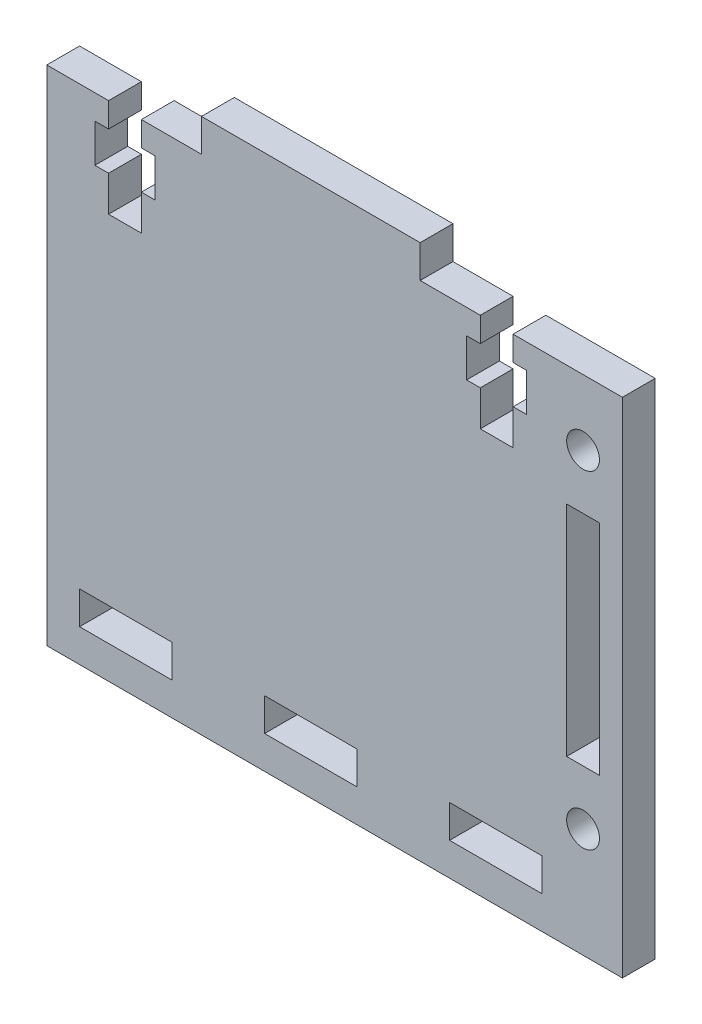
ISO-10303-21;
HEADER;
FILE_DESCRIPTION(('STEP AP214'),'2;1');
FILE_NAME('part.step','',(''),(''),'','','');
FILE_SCHEMA(('AUTOMOTIVE_DESIGN { 1 0 10303 214 1 1 1 1 }'));
ENDSEC;
DATA;
#1=APPLICATION_CONTEXT('core data for automotive mechanical design processes');
#2=APPLICATION_PROTOCOL_DEFINITION('international standard','automotive_design',2000,#1);
#3=PRODUCT_CONTEXT('',#1,'mechanical');
#4=PRODUCT('Part','Part','',(#3));
#5=PRODUCT_RELATED_PRODUCT_CATEGORY('part','',(#4));
#6=PRODUCT_DEFINITION_FORMATION('','',#4);
#7=PRODUCT_DEFINITION_CONTEXT('part definition',#1,'design');
#8=PRODUCT_DEFINITION('design','',#6,#7);
#9=PRODUCT_DEFINITION_SHAPE('','',#8);
#10=(LENGTH_UNIT() NAMED_UNIT(*) SI_UNIT(.MILLI.,.METRE.));
#11=(NAMED_UNIT(*) PLANE_ANGLE_UNIT() SI_UNIT($,.RADIAN.));
#12=(NAMED_UNIT(*) SI_UNIT($,.STERADIAN.) SOLID_ANGLE_UNIT());
#13=UNCERTAINTY_MEASURE_WITH_UNIT(LENGTH_MEASURE(1.E-05),#10,'distance_accuracy_value','');
#14=(GEOMETRIC_REPRESENTATION_CONTEXT(3) GLOBAL_UNCERTAINTY_ASSIGNED_CONTEXT((#13)) GLOBAL_UNIT_ASSIGNED_CONTEXT((#10,
#11,#12)) REPRESENTATION_CONTEXT('',''));
#15=CARTESIAN_POINT('',(0.,0.,0.));
#16=DIRECTION('',(0.,0.,1.));
#17=DIRECTION('',(1.,0.,0.));
#18=AXIS2_PLACEMENT_3D('',#15,#16,#17);
#19=CARTESIAN_POINT('',(0.,10.4999999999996,3.));
#20=DIRECTION('',(0.,1.,0.));
#21=DIRECTION('',(0.,0.,1.));
#22=AXIS2_PLACEMENT_3D('',#19,#20,#21);
#23=PLANE('',#22);
#24=DIRECTION('',(1.,0.,0.));
#25=VECTOR('',#24,1.);
#26=CARTESIAN_POINT('',(0.,10.4999999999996,0.));
#27=LINE('',#26,#25);
#28=CARTESIAN_POINT('',(21.2249999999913,10.4999999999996,0.));
#29=VERTEX_POINT('',#28);
#30=CARTESIAN_POINT('',(24.2249999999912,10.4999999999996,0.));
#31=VERTEX_POINT('',#30);
#32=EDGE_CURVE('E488',#29,#31,#27,.T.);
#33=ORIENTED_EDGE('',*,*,#32,.T.);
#34=DIRECTION('',(0.,0.,-1.));
#35=VECTOR('',#34,1.);
#36=CARTESIAN_POINT('',(24.2249999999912,10.4999999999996,3.));
#37=LINE('',#36,#35);
#38=CARTESIAN_POINT('',(24.2249999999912,10.4999999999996,3.));
#39=VERTEX_POINT('',#38);
#40=EDGE_CURVE('E11',#39,#31,#37,.T.);
#41=ORIENTED_EDGE('',*,*,#40,.F.);
#42=DIRECTION('',(1.,0.,0.));
#43=VECTOR('',#42,1.);
#44=CARTESIAN_POINT('',(0.,10.4999999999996,3.));
#45=LINE('',#44,#43);
#46=CARTESIAN_POINT('',(21.2249999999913,10.4999999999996,3.));
#47=VERTEX_POINT('',#46);
#48=EDGE_CURVE('E355',#47,#39,#45,.T.);
#49=ORIENTED_EDGE('',*,*,#48,.F.);
#50=DIRECTION('',(0.,0.,-1.));
#51=VECTOR('',#50,1.);
#52=CARTESIAN_POINT('',(21.2249999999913,10.4999999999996,3.));
#53=LINE('',#52,#51);
#54=EDGE_CURVE('E55',#47,#29,#53,.T.);
#55=ORIENTED_EDGE('',*,*,#54,.T.);
#56=EDGE_LOOP('',(#33,#41,#49,#55));
#57=FACE_BOUND('',#56,.T.);
#58=ADVANCED_FACE('F36',(#57),#23,.F.);
#59=CARTESIAN_POINT('',(24.2249999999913,2.68951527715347E-13,3.));
#60=DIRECTION('',(1.,0.,0.));
#61=DIRECTION('',(0.,1.,0.));
#62=AXIS2_PLACEMENT_3D('',#59,#60,#61);
#63=PLANE('',#62);
#64=DIRECTION('',(0.,-1.,0.));
#65=VECTOR('',#64,1.);
#66=CARTESIAN_POINT('',(24.2249999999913,2.68951527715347E-13,0.));
#67=LINE('',#66,#65);
#68=CARTESIAN_POINT('',(24.2249999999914,-9.5000000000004,0.));
#69=VERTEX_POINT('',#68);
#70=EDGE_CURVE('E361',#31,#69,#67,.T.);
#71=ORIENTED_EDGE('',*,*,#70,.T.);
#72=DIRECTION('',(0.,0.,-1.));
#73=VECTOR('',#72,1.);
#74=CARTESIAN_POINT('',(24.2249999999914,-9.5000000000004,3.));
#75=LINE('',#74,#73);
#76=CARTESIAN_POINT('',(24.2249999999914,-9.5000000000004,3.));
#77=VERTEX_POINT('',#76);
#78=EDGE_CURVE('E46',#77,#69,#75,.T.);
#79=ORIENTED_EDGE('',*,*,#78,.F.);
#80=DIRECTION('',(0.,-1.,0.));
#81=VECTOR('',#80,1.);
#82=CARTESIAN_POINT('',(24.2249999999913,2.68951527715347E-13,3.));
#83=LINE('',#82,#81);
#84=EDGE_CURVE('E349',#39,#77,#83,.T.);
#85=ORIENTED_EDGE('',*,*,#84,.F.);
#86=ORIENTED_EDGE('',*,*,#40,.T.);
#87=EDGE_LOOP('',(#71,#79,#85,#86));
#88=FACE_BOUND('',#87,.T.);
#89=ADVANCED_FACE('F360',(#88),#63,.F.);
#90=CARTESIAN_POINT('',(0.,-9.5000000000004,3.));
#91=DIRECTION('',(0.,1.,0.));
#92=DIRECTION('',(0.,0.,1.));
#93=AXIS2_PLACEMENT_3D('',#90,#91,#92);
#94=PLANE('',#93);
#95=DIRECTION('',(1.,0.,0.));
#96=VECTOR('',#95,1.);
#97=CARTESIAN_POINT('',(0.,-9.5000000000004,0.));
#98=LINE('',#97,#96);
#99=CARTESIAN_POINT('',(21.2249999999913,-9.5000000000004,0.));
#100=VERTEX_POINT('',#99);
#101=EDGE_CURVE('E491',#100,#69,#98,.T.);
#102=ORIENTED_EDGE('',*,*,#101,.F.);
#103=DIRECTION('',(0.,0.,-1.));
#104=VECTOR('',#103,1.);
#105=CARTESIAN_POINT('',(21.2249999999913,-9.5000000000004,3.));
#106=LINE('',#105,#104);
#107=CARTESIAN_POINT('',(21.2249999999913,-9.5000000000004,3.));
#108=VERTEX_POINT('',#107);
#109=EDGE_CURVE('E201',#108,#100,#106,.T.);
#110=ORIENTED_EDGE('',*,*,#109,.F.);
#111=DIRECTION('',(1.,0.,0.));
#112=VECTOR('',#111,1.);
#113=CARTESIAN_POINT('',(0.,-9.5000000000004,3.));
#114=LINE('',#113,#112);
#115=EDGE_CURVE('E354',#108,#77,#114,.T.);
#116=ORIENTED_EDGE('',*,*,#115,.T.);
#117=ORIENTED_EDGE('',*,*,#78,.T.);
#118=EDGE_LOOP('',(#102,#110,#116,#117));
#119=FACE_BOUND('',#118,.T.);
#120=ADVANCED_FACE('F365',(#119),#94,.T.);
#121=CARTESIAN_POINT('',(0.,-18.5000000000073,3.));
#122=DIRECTION('',(0.,1.,0.));
#123=DIRECTION('',(0.,0.,1.));
#124=AXIS2_PLACEMENT_3D('',#121,#122,#123);
#125=PLANE('',#124);
#126=DIRECTION('',(1.,0.,0.));
#127=VECTOR('',#126,1.);
#128=CARTESIAN_POINT('',(0.,-18.5000000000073,0.));
#129=LINE('',#128,#127);
#130=CARTESIAN_POINT('',(10.5150000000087,-18.5000000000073,0.));
#131=VERTEX_POINT('',#130);
#132=CARTESIAN_POINT('',(18.9750000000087,-18.5000000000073,0.));
#133=VERTEX_POINT('',#132);
#134=EDGE_CURVE('E476',#131,#133,#129,.T.);
#135=ORIENTED_EDGE('',*,*,#134,.T.);
#136=DIRECTION('',(0.,0.,-1.));
#137=VECTOR('',#136,1.);
#138=CARTESIAN_POINT('',(18.9750000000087,-18.5000000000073,3.));
#139=LINE('',#138,#137);
#140=CARTESIAN_POINT('',(18.9750000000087,-18.5000000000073,3.));
#141=VERTEX_POINT('',#140);
#142=EDGE_CURVE('E498',#141,#133,#139,.T.);
#143=ORIENTED_EDGE('',*,*,#142,.F.);
#144=DIRECTION('',(1.,0.,0.));
#145=VECTOR('',#144,1.);
#146=CARTESIAN_POINT('',(0.,-18.5000000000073,3.));
#147=LINE('',#146,#145);
#148=CARTESIAN_POINT('',(10.5150000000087,-18.5000000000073,3.));
#149=VERTEX_POINT('',#148);
#150=EDGE_CURVE('E709',#149,#141,#147,.T.);
#151=ORIENTED_EDGE('',*,*,#150,.F.);
#152=DIRECTION('',(0.,0.,-1.));
#153=VECTOR('',#152,1.);
#154=CARTESIAN_POINT('',(10.5150000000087,-18.5000000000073,3.));
#155=LINE('',#154,#153);
#156=EDGE_CURVE('E500',#149,#131,#155,.T.);
#157=ORIENTED_EDGE('',*,*,#156,.T.);
#158=EDGE_LOOP('',(#135,#143,#151,#157));
#159=FACE_BOUND('',#158,.T.);
#160=ADVANCED_FACE('F735',(#159),#125,.F.);
#161=CARTESIAN_POINT('',(18.9750000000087,0.,3.));
#162=DIRECTION('',(1.,0.,0.));
#163=DIRECTION('',(0.,0.,-1.));
#164=AXIS2_PLACEMENT_3D('',#161,#162,#163);
#165=PLANE('',#164);
#166=DIRECTION('',(0.,-1.,0.));
#167=VECTOR('',#166,1.);
#168=CARTESIAN_POINT('',(18.9750000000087,0.,0.));
#169=LINE('',#168,#167);
#170=CARTESIAN_POINT('',(18.9750000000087,-21.5000000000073,0.));
#171=VERTEX_POINT('',#170);
#172=EDGE_CURVE('E479',#133,#171,#169,.T.);
#173=ORIENTED_EDGE('',*,*,#172,.T.);
#174=DIRECTION('',(0.,0.,-1.));
#175=VECTOR('',#174,1.);
#176=CARTESIAN_POINT('',(18.9750000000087,-21.5000000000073,3.));
#177=LINE('',#176,#175);
#178=CARTESIAN_POINT('',(18.9750000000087,-21.5000000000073,3.));
#179=VERTEX_POINT('',#178);
#180=EDGE_CURVE('E505',#179,#171,#177,.T.);
#181=ORIENTED_EDGE('',*,*,#180,.F.);
#182=DIRECTION('',(0.,-1.,0.));
#183=VECTOR('',#182,1.);
#184=CARTESIAN_POINT('',(18.9750000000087,0.,3.));
#185=LINE('',#184,#183);
#186=EDGE_CURVE('E712',#141,#179,#185,.T.);
#187=ORIENTED_EDGE('',*,*,#186,.F.);
#188=ORIENTED_EDGE('',*,*,#142,.T.);
#189=EDGE_LOOP('',(#173,#181,#187,#188));
#190=FACE_BOUND('',#189,.T.);
#191=ADVANCED_FACE('F737',(#190),#165,.F.);
#192=CARTESIAN_POINT('',(0.,-21.5000000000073,3.));
#193=DIRECTION('',(0.,1.,0.));
#194=DIRECTION('',(0.,0.,1.));
#195=AXIS2_PLACEMENT_3D('',#192,#193,#194);
#196=PLANE('',#195);
#197=DIRECTION('',(1.,0.,0.));
#198=VECTOR('',#197,1.);
#199=CARTESIAN_POINT('',(0.,-21.5000000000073,0.));
#200=LINE('',#199,#198);
#201=CARTESIAN_POINT('',(10.5150000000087,-21.5000000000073,0.));
#202=VERTEX_POINT('',#201);
#203=EDGE_CURVE('E482',#202,#171,#200,.T.);
#204=ORIENTED_EDGE('',*,*,#203,.F.);
#205=DIRECTION('',(0.,0.,-1.));
#206=VECTOR('',#205,1.);
#207=CARTESIAN_POINT('',(10.5150000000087,-21.5000000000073,3.));
#208=LINE('',#207,#206);
#209=CARTESIAN_POINT('',(10.5150000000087,-21.5000000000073,3.));
#210=VERTEX_POINT('',#209);
#211=EDGE_CURVE('E502',#210,#202,#208,.T.);
#212=ORIENTED_EDGE('',*,*,#211,.F.);
#213=DIRECTION('',(1.,0.,0.));
#214=VECTOR('',#213,1.);
#215=CARTESIAN_POINT('',(0.,-21.5000000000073,3.));
#216=LINE('',#215,#214);
#217=EDGE_CURVE('E714',#210,#179,#216,.T.);
#218=ORIENTED_EDGE('',*,*,#217,.T.);
#219=ORIENTED_EDGE('',*,*,#180,.T.);
#220=EDGE_LOOP('',(#204,#212,#218,#219));
#221=FACE_BOUND('',#220,.T.);
#222=ADVANCED_FACE('F730',(#221),#196,.T.);
#223=CARTESIAN_POINT('',(0.,-18.5000000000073,3.));
#224=DIRECTION('',(0.,1.,0.));
#225=DIRECTION('',(0.,0.,1.));
#226=AXIS2_PLACEMENT_3D('',#223,#224,#225);
#227=PLANE('',#226);
#228=DIRECTION('',(1.,0.,0.));
#229=VECTOR('',#228,1.);
#230=CARTESIAN_POINT('',(0.,-18.5000000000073,0.));
#231=LINE('',#230,#229);
#232=CARTESIAN_POINT('',(-6.40499999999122,-18.5000000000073,0.));
#233=VERTEX_POINT('',#232);
#234=CARTESIAN_POINT('',(2.0550000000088,-18.5000000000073,0.));
#235=VERTEX_POINT('',#234);
#236=EDGE_CURVE('E464',#233,#235,#231,.T.);
#237=ORIENTED_EDGE('',*,*,#236,.T.);
#238=DIRECTION('',(0.,0.,-1.));
#239=VECTOR('',#238,1.);
#240=CARTESIAN_POINT('',(2.0550000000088,-18.5000000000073,3.));
#241=LINE('',#240,#239);
#242=CARTESIAN_POINT('',(2.0550000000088,-18.5000000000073,3.));
#243=VERTEX_POINT('',#242);
#244=EDGE_CURVE('E503',#243,#235,#241,.T.);
#245=ORIENTED_EDGE('',*,*,#244,.F.);
#246=DIRECTION('',(1.,0.,0.));
#247=VECTOR('',#246,1.);
#248=CARTESIAN_POINT('',(0.,-18.5000000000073,3.));
#249=LINE('',#248,#247);
#250=CARTESIAN_POINT('',(-6.40499999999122,-18.5000000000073,3.));
#251=VERTEX_POINT('',#250);
#252=EDGE_CURVE('E698',#251,#243,#249,.T.);
#253=ORIENTED_EDGE('',*,*,#252,.F.);
#254=DIRECTION('',(0.,0.,-1.));
#255=VECTOR('',#254,1.);
#256=CARTESIAN_POINT('',(-6.40499999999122,-18.5000000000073,3.));
#257=LINE('',#256,#255);
#258=EDGE_CURVE('E509',#251,#233,#257,.T.);
#259=ORIENTED_EDGE('',*,*,#258,.T.);
#260=EDGE_LOOP('',(#237,#245,#253,#259));
#261=FACE_BOUND('',#260,.T.);
#262=ADVANCED_FACE('F744',(#261),#227,.F.);
#263=CARTESIAN_POINT('',(2.0550000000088,0.,3.));
#264=DIRECTION('',(1.,0.,0.));
#265=DIRECTION('',(0.,0.,-1.));
#266=AXIS2_PLACEMENT_3D('',#263,#264,#265);
#267=PLANE('',#266);
#268=DIRECTION('',(0.,-1.,0.));
#269=VECTOR('',#268,1.);
#270=CARTESIAN_POINT('',(2.0550000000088,0.,0.));
#271=LINE('',#270,#269);
#272=CARTESIAN_POINT('',(2.0550000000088,-21.5000000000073,0.));
#273=VERTEX_POINT('',#272);
#274=EDGE_CURVE('E467',#235,#273,#271,.T.);
#275=ORIENTED_EDGE('',*,*,#274,.T.);
#276=DIRECTION('',(0.,0.,-1.));
#277=VECTOR('',#276,1.);
#278=CARTESIAN_POINT('',(2.0550000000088,-21.5000000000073,3.));
#279=LINE('',#278,#277);
#280=CARTESIAN_POINT('',(2.0550000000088,-21.5000000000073,3.));
#281=VERTEX_POINT('',#280);
#282=EDGE_CURVE('E514',#281,#273,#279,.T.);
#283=ORIENTED_EDGE('',*,*,#282,.F.);
#284=DIRECTION('',(0.,-1.,0.));
#285=VECTOR('',#284,1.);
#286=CARTESIAN_POINT('',(2.0550000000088,0.,3.));
#287=LINE('',#286,#285);
#288=EDGE_CURVE('E701',#243,#281,#287,.T.);
#289=ORIENTED_EDGE('',*,*,#288,.F.);
#290=ORIENTED_EDGE('',*,*,#244,.T.);
#291=EDGE_LOOP('',(#275,#283,#289,#290));
#292=FACE_BOUND('',#291,.T.);
#293=ADVANCED_FACE('F871',(#292),#267,.F.);
#294=CARTESIAN_POINT('',(0.,-21.5000000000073,3.));
#295=DIRECTION('',(0.,1.,0.));
#296=DIRECTION('',(0.,0.,1.));
#297=AXIS2_PLACEMENT_3D('',#294,#295,#296);
#298=PLANE('',#297);
#299=DIRECTION('',(1.,0.,0.));
#300=VECTOR('',#299,1.);
#301=CARTESIAN_POINT('',(0.,-21.5000000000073,0.));
#302=LINE('',#301,#300);
#303=CARTESIAN_POINT('',(-6.40499999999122,-21.5000000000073,0.));
#304=VERTEX_POINT('',#303);
#305=EDGE_CURVE('E470',#304,#273,#302,.T.);
#306=ORIENTED_EDGE('',*,*,#305,.F.);
#307=DIRECTION('',(0.,0.,-1.));
#308=VECTOR('',#307,1.);
#309=CARTESIAN_POINT('',(-6.40499999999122,-21.5000000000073,3.));
#310=LINE('',#309,#308);
#311=CARTESIAN_POINT('',(-6.40499999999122,-21.5000000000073,3.));
#312=VERTEX_POINT('',#311);
#313=EDGE_CURVE('E511',#312,#304,#310,.T.);
#314=ORIENTED_EDGE('',*,*,#313,.F.);
#315=DIRECTION('',(1.,0.,0.));
#316=VECTOR('',#315,1.);
#317=CARTESIAN_POINT('',(0.,-21.5000000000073,3.));
#318=LINE('',#317,#316);
#319=EDGE_CURVE('E703',#312,#281,#318,.T.);
#320=ORIENTED_EDGE('',*,*,#319,.T.);
#321=ORIENTED_EDGE('',*,*,#282,.T.);
#322=EDGE_LOOP('',(#306,#314,#320,#321));
#323=FACE_BOUND('',#322,.T.);
#324=ADVANCED_FACE('F881',(#323),#298,.T.);
#325=CARTESIAN_POINT('',(0.,-18.5000000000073,3.));
#326=DIRECTION('',(0.,1.,0.));
#327=DIRECTION('',(0.,0.,1.));
#328=AXIS2_PLACEMENT_3D('',#325,#326,#327);
#329=PLANE('',#328);
#330=DIRECTION('',(1.,0.,0.));
#331=VECTOR('',#330,1.);
#332=CARTESIAN_POINT('',(0.,-18.5000000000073,0.));
#333=LINE('',#332,#331);
#334=CARTESIAN_POINT('',(-23.3249999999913,-18.5000000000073,0.));
#335=VERTEX_POINT('',#334);
#336=CARTESIAN_POINT('',(-14.8649999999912,-18.5000000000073,0.));
#337=VERTEX_POINT('',#336);
#338=EDGE_CURVE('E452',#335,#337,#333,.T.);
#339=ORIENTED_EDGE('',*,*,#338,.T.);
#340=DIRECTION('',(0.,0.,-1.));
#341=VECTOR('',#340,1.);
#342=CARTESIAN_POINT('',(-14.8649999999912,-18.5000000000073,3.));
#343=LINE('',#342,#341);
#344=CARTESIAN_POINT('',(-14.8649999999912,-18.5000000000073,3.));
#345=VERTEX_POINT('',#344);
#346=EDGE_CURVE('E512',#345,#337,#343,.T.);
#347=ORIENTED_EDGE('',*,*,#346,.F.);
#348=DIRECTION('',(1.,0.,0.));
#349=VECTOR('',#348,1.);
#350=CARTESIAN_POINT('',(0.,-18.5000000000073,3.));
#351=LINE('',#350,#349);
#352=CARTESIAN_POINT('',(-23.3249999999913,-18.5000000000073,3.));
#353=VERTEX_POINT('',#352);
#354=EDGE_CURVE('E687',#353,#345,#351,.T.);
#355=ORIENTED_EDGE('',*,*,#354,.F.);
#356=DIRECTION('',(0.,0.,-1.));
#357=VECTOR('',#356,1.);
#358=CARTESIAN_POINT('',(-23.3249999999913,-18.5000000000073,3.));
#359=LINE('',#358,#357);
#360=EDGE_CURVE('E518',#353,#335,#359,.T.);
#361=ORIENTED_EDGE('',*,*,#360,.T.);
#362=EDGE_LOOP('',(#339,#347,#355,#361));
#363=FACE_BOUND('',#362,.T.);
#364=ADVANCED_FACE('F891',(#363),#329,.F.);
#365=CARTESIAN_POINT('',(-14.8649999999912,0.,3.));
#366=DIRECTION('',(1.,0.,0.));
#367=DIRECTION('',(0.,0.,-1.));
#368=AXIS2_PLACEMENT_3D('',#365,#366,#367);
#369=PLANE('',#368);
#370=DIRECTION('',(0.,-1.,0.));
#371=VECTOR('',#370,1.);
#372=CARTESIAN_POINT('',(-14.8649999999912,0.,0.));
#373=LINE('',#372,#371);
#374=CARTESIAN_POINT('',(-14.8649999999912,-21.5000000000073,0.));
#375=VERTEX_POINT('',#374);
#376=EDGE_CURVE('E455',#337,#375,#373,.T.);
#377=ORIENTED_EDGE('',*,*,#376,.T.);
#378=DIRECTION('',(0.,0.,-1.));
#379=VECTOR('',#378,1.);
#380=CARTESIAN_POINT('',(-14.8649999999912,-21.5000000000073,3.));
#381=LINE('',#380,#379);
#382=CARTESIAN_POINT('',(-14.8649999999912,-21.5000000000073,3.));
#383=VERTEX_POINT('',#382);
#384=EDGE_CURVE('E522',#383,#375,#381,.T.);
#385=ORIENTED_EDGE('',*,*,#384,.F.);
#386=DIRECTION('',(0.,-1.,0.));
#387=VECTOR('',#386,1.);
#388=CARTESIAN_POINT('',(-14.8649999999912,0.,3.));
#389=LINE('',#388,#387);
#390=EDGE_CURVE('E690',#345,#383,#389,.T.);
#391=ORIENTED_EDGE('',*,*,#390,.F.);
#392=ORIENTED_EDGE('',*,*,#346,.T.);
#393=EDGE_LOOP('',(#377,#385,#391,#392));
#394=FACE_BOUND('',#393,.T.);
#395=ADVANCED_FACE('F901',(#394),#369,.F.);
#396=CARTESIAN_POINT('',(0.,-21.5000000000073,3.));
#397=DIRECTION('',(0.,1.,0.));
#398=DIRECTION('',(0.,0.,1.));
#399=AXIS2_PLACEMENT_3D('',#396,#397,#398);
#400=PLANE('',#399);
#401=DIRECTION('',(1.,0.,0.));
#402=VECTOR('',#401,1.);
#403=CARTESIAN_POINT('',(0.,-21.5000000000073,0.));
#404=LINE('',#403,#402);
#405=CARTESIAN_POINT('',(-23.3249999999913,-21.5000000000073,0.));
#406=VERTEX_POINT('',#405);
#407=EDGE_CURVE('E458',#406,#375,#404,.T.);
#408=ORIENTED_EDGE('',*,*,#407,.F.);
#409=DIRECTION('',(0.,0.,-1.));
#410=VECTOR('',#409,1.);
#411=CARTESIAN_POINT('',(-23.3249999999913,-21.5000000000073,3.));
#412=LINE('',#411,#410);
#413=CARTESIAN_POINT('',(-23.3249999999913,-21.5000000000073,3.));
#414=VERTEX_POINT('',#413);
#415=EDGE_CURVE('E520',#414,#406,#412,.T.);
#416=ORIENTED_EDGE('',*,*,#415,.F.);
#417=DIRECTION('',(1.,0.,0.));
#418=VECTOR('',#417,1.);
#419=CARTESIAN_POINT('',(0.,-21.5000000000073,3.));
#420=LINE('',#419,#418);
#421=EDGE_CURVE('E692',#414,#383,#420,.T.);
#422=ORIENTED_EDGE('',*,*,#421,.T.);
#423=ORIENTED_EDGE('',*,*,#384,.T.);
#424=EDGE_LOOP('',(#408,#416,#422,#423));
#425=FACE_BOUND('',#424,.T.);
#426=ADVANCED_FACE('F790',(#425),#400,.T.);
#427=CARTESIAN_POINT('',(-16.4250000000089,0.,3.));
#428=DIRECTION('',(-1.,0.,0.));
#429=DIRECTION('',(0.,0.,1.));
#430=AXIS2_PLACEMENT_3D('',#427,#428,#429);
#431=PLANE('',#430);
#432=DIRECTION('',(0.,1.,0.));
#433=VECTOR('',#432,1.);
#434=CARTESIAN_POINT('',(-16.4250000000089,0.,0.));
#435=LINE('',#434,#433);
#436=CARTESIAN_POINT('',(-16.4250000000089,15.7499999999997,0.));
#437=VERTEX_POINT('',#436);
#438=CARTESIAN_POINT('',(-16.4250000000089,19.2499999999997,0.));
#439=VERTEX_POINT('',#438);
#440=EDGE_CURVE('E378',#437,#439,#435,.T.);
#441=ORIENTED_EDGE('',*,*,#440,.F.);
#442=DIRECTION('',(0.,0.,-1.));
#443=VECTOR('',#442,1.);
#444=CARTESIAN_POINT('',(-16.4250000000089,15.7499999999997,3.));
#445=LINE('',#444,#443);
#446=CARTESIAN_POINT('',(-16.4250000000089,15.7499999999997,3.));
#447=VERTEX_POINT('',#446);
#448=EDGE_CURVE('E40',#447,#437,#445,.T.);
#449=ORIENTED_EDGE('',*,*,#448,.F.);
#450=DIRECTION('',(0.,1.,0.));
#451=VECTOR('',#450,1.);
#452=CARTESIAN_POINT('',(-16.4250000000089,0.,3.));
#453=LINE('',#452,#451);
#454=CARTESIAN_POINT('',(-16.4250000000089,19.2499999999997,3.));
#455=VERTEX_POINT('',#454);
#456=EDGE_CURVE('E814',#447,#455,#453,.T.);
#457=ORIENTED_EDGE('',*,*,#456,.T.);
#458=DIRECTION('',(0.,0.,-1.));
#459=VECTOR('',#458,1.);
#460=CARTESIAN_POINT('',(-16.4250000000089,19.2499999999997,3.));
#461=LINE('',#460,#459);
#462=EDGE_CURVE('E368',#455,#439,#461,.T.);
#463=ORIENTED_EDGE('',*,*,#462,.T.);
#464=EDGE_LOOP('',(#441,#449,#457,#463));
#465=FACE_BOUND('',#464,.T.);
#466=ADVANCED_FACE('F605',(#465),#431,.T.);
#467=CARTESIAN_POINT('',(0.,15.7499999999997,3.));
#468=DIRECTION('',(0.,1.,0.));
#469=DIRECTION('',(0.,0.,1.));
#470=AXIS2_PLACEMENT_3D('',#467,#468,#469);
#471=PLANE('',#470);
#472=DIRECTION('',(1.,0.,0.));
#473=VECTOR('',#472,1.);
#474=CARTESIAN_POINT('',(0.,15.7499999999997,0.));
#475=LINE('',#474,#473);
#476=CARTESIAN_POINT('',(-17.6750000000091,15.7499999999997,0.));
#477=VERTEX_POINT('',#476);
#478=EDGE_CURVE('E381',#477,#437,#475,.T.);
#479=ORIENTED_EDGE('',*,*,#478,.F.);
#480=DIRECTION('',(0.,0.,-1.));
#481=VECTOR('',#480,1.);
#482=CARTESIAN_POINT('',(-17.6750000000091,15.7499999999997,3.));
#483=LINE('',#482,#481);
#484=CARTESIAN_POINT('',(-17.6750000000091,15.7499999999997,3.));
#485=VERTEX_POINT('',#484);
#486=EDGE_CURVE('E595',#485,#477,#483,.T.);
#487=ORIENTED_EDGE('',*,*,#486,.F.);
#488=DIRECTION('',(1.,0.,0.));
#489=VECTOR('',#488,1.);
#490=CARTESIAN_POINT('',(0.,15.7499999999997,3.));
#491=LINE('',#490,#489);
#492=EDGE_CURVE('E604',#485,#447,#491,.T.);
#493=ORIENTED_EDGE('',*,*,#492,.T.);
#494=ORIENTED_EDGE('',*,*,#448,.T.);
#495=EDGE_LOOP('',(#479,#487,#493,#494));
#496=FACE_BOUND('',#495,.T.);
#497=ADVANCED_FACE('F602',(#496),#471,.T.);
#498=CARTESIAN_POINT('',(-17.6750000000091,0.,3.));
#499=DIRECTION('',(-1.,0.,0.));
#500=DIRECTION('',(0.,0.,1.));
#501=AXIS2_PLACEMENT_3D('',#498,#499,#500);
#502=PLANE('',#501);
#503=DIRECTION('',(0.,1.,0.));
#504=VECTOR('',#503,1.);
#505=CARTESIAN_POINT('',(-17.6750000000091,0.,0.));
#506=LINE('',#505,#504);
#507=CARTESIAN_POINT('',(-17.6750000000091,12.4999999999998,0.));
#508=VERTEX_POINT('',#507);
#509=EDGE_CURVE('E384',#508,#477,#506,.T.);
#510=ORIENTED_EDGE('',*,*,#509,.F.);
#511=DIRECTION('',(0.,0.,-1.));
#512=VECTOR('',#511,1.);
#513=CARTESIAN_POINT('',(-17.6750000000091,12.4999999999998,3.));
#514=LINE('',#513,#512);
#515=CARTESIAN_POINT('',(-17.6750000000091,12.4999999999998,3.));
#516=VERTEX_POINT('',#515);
#517=EDGE_CURVE('E594',#516,#508,#514,.T.);
#518=ORIENTED_EDGE('',*,*,#517,.F.);
#519=DIRECTION('',(0.,1.,0.));
#520=VECTOR('',#519,1.);
#521=CARTESIAN_POINT('',(-17.6750000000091,0.,3.));
#522=LINE('',#521,#520);
#523=EDGE_CURVE('E616',#516,#485,#522,.T.);
#524=ORIENTED_EDGE('',*,*,#523,.T.);
#525=ORIENTED_EDGE('',*,*,#486,.T.);
#526=EDGE_LOOP('',(#510,#518,#524,#525));
#527=FACE_BOUND('',#526,.T.);
#528=ADVANCED_FACE('F614',(#527),#502,.T.);
#529=CARTESIAN_POINT('',(2.31296463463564E-13,12.4999999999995,3.));
#530=DIRECTION('',(0.,1.,0.));
#531=DIRECTION('',(-1.,0.,0.));
#532=AXIS2_PLACEMENT_3D('',#529,#530,#531);
#533=PLANE('',#532);
#534=DIRECTION('',(1.,0.,0.));
#535=VECTOR('',#534,1.);
#536=CARTESIAN_POINT('',(2.31296463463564E-13,12.4999999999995,0.));
#537=LINE('',#536,#535);
#538=CARTESIAN_POINT('',(-20.6750000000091,12.4999999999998,0.));
#539=VERTEX_POINT('',#538);
#540=EDGE_CURVE('E388',#539,#508,#537,.T.);
#541=ORIENTED_EDGE('',*,*,#540,.F.);
#542=DIRECTION('',(0.,0.,-1.));
#543=VECTOR('',#542,1.);
#544=CARTESIAN_POINT('',(-20.6750000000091,12.4999999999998,3.));
#545=LINE('',#544,#543);
#546=CARTESIAN_POINT('',(-20.6750000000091,12.4999999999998,3.));
#547=VERTEX_POINT('',#546);
#548=EDGE_CURVE('E592',#547,#539,#545,.T.);
#549=ORIENTED_EDGE('',*,*,#548,.F.);
#550=DIRECTION('',(1.,0.,0.));
#551=VECTOR('',#550,1.);
#552=CARTESIAN_POINT('',(2.31296463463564E-13,12.4999999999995,3.));
#553=LINE('',#552,#551);
#554=EDGE_CURVE('E622',#547,#516,#553,.T.);
#555=ORIENTED_EDGE('',*,*,#554,.T.);
#556=ORIENTED_EDGE('',*,*,#517,.T.);
#557=EDGE_LOOP('',(#541,#549,#555,#556));
#558=FACE_BOUND('',#557,.T.);
#559=ADVANCED_FACE('F625',(#558),#533,.T.);
#560=CARTESIAN_POINT('',(-20.6750000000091,0.,3.));
#561=DIRECTION('',(-1.,0.,0.));
#562=DIRECTION('',(0.,0.,1.));
#563=AXIS2_PLACEMENT_3D('',#560,#561,#562);
#564=PLANE('',#563);
#565=DIRECTION('',(0.,1.,0.));
#566=VECTOR('',#565,1.);
#567=CARTESIAN_POINT('',(-20.6750000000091,0.,0.));
#568=LINE('',#567,#566);
#569=CARTESIAN_POINT('',(-20.6750000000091,15.7499999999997,0.));
#570=VERTEX_POINT('',#569);
#571=EDGE_CURVE('E392',#539,#570,#568,.T.);
#572=ORIENTED_EDGE('',*,*,#571,.T.);
#573=DIRECTION('',(0.,0.,-1.));
#574=VECTOR('',#573,1.);
#575=CARTESIAN_POINT('',(-20.6750000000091,15.7499999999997,3.));
#576=LINE('',#575,#574);
#577=CARTESIAN_POINT('',(-20.6750000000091,15.7499999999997,3.));
#578=VERTEX_POINT('',#577);
#579=EDGE_CURVE('E590',#578,#570,#576,.T.);
#580=ORIENTED_EDGE('',*,*,#579,.F.);
#581=DIRECTION('',(0.,1.,0.));
#582=VECTOR('',#581,1.);
#583=CARTESIAN_POINT('',(-20.6750000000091,0.,3.));
#584=LINE('',#583,#582);
#585=EDGE_CURVE('E627',#547,#578,#584,.T.);
#586=ORIENTED_EDGE('',*,*,#585,.F.);
#587=ORIENTED_EDGE('',*,*,#548,.T.);
#588=EDGE_LOOP('',(#572,#580,#586,#587));
#589=FACE_BOUND('',#588,.T.);
#590=ADVANCED_FACE('F783',(#589),#564,.F.);
#591=CARTESIAN_POINT('',(-21.9250000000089,15.7499999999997,0.));
#592=VERTEX_POINT('',#591);
#593=EDGE_CURVE('E385',#592,#570,#475,.T.);
#594=ORIENTED_EDGE('',*,*,#593,.F.);
#595=DIRECTION('',(0.,0.,-1.));
#596=VECTOR('',#595,1.);
#597=CARTESIAN_POINT('',(-21.9250000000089,15.7499999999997,3.));
#598=LINE('',#597,#596);
#599=CARTESIAN_POINT('',(-21.9250000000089,15.7499999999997,3.));
#600=VERTEX_POINT('',#599);
#601=EDGE_CURVE('E588',#600,#592,#598,.T.);
#602=ORIENTED_EDGE('',*,*,#601,.F.);
#603=EDGE_CURVE('E629',#600,#578,#491,.T.);
#604=ORIENTED_EDGE('',*,*,#603,.T.);
#605=ORIENTED_EDGE('',*,*,#579,.T.);
#606=EDGE_LOOP('',(#594,#602,#604,#605));
#607=FACE_BOUND('',#606,.T.);
#608=ADVANCED_FACE('F786',(#607),#471,.T.);
#609=CARTESIAN_POINT('',(-21.9250000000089,0.,3.));
#610=DIRECTION('',(-1.,0.,0.));
#611=DIRECTION('',(0.,0.,1.));
#612=AXIS2_PLACEMENT_3D('',#609,#610,#611);
#613=PLANE('',#612);
#614=DIRECTION('',(0.,1.,0.));
#615=VECTOR('',#614,1.);
#616=CARTESIAN_POINT('',(-21.9250000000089,0.,0.));
#617=LINE('',#616,#615);
#618=CARTESIAN_POINT('',(-21.9250000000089,19.2499999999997,0.));
#619=VERTEX_POINT('',#618);
#620=EDGE_CURVE('E396',#592,#619,#617,.T.);
#621=ORIENTED_EDGE('',*,*,#620,.T.);
#622=DIRECTION('',(0.,0.,-1.));
#623=VECTOR('',#622,1.);
#624=CARTESIAN_POINT('',(-21.9250000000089,19.2499999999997,3.));
#625=LINE('',#624,#623);
#626=CARTESIAN_POINT('',(-21.9250000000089,19.2499999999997,3.));
#627=VERTEX_POINT('',#626);
#628=EDGE_CURVE('E585',#627,#619,#625,.T.);
#629=ORIENTED_EDGE('',*,*,#628,.F.);
#630=DIRECTION('',(0.,1.,0.));
#631=VECTOR('',#630,1.);
#632=CARTESIAN_POINT('',(-21.9250000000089,0.,3.));
#633=LINE('',#632,#631);
#634=EDGE_CURVE('E634',#600,#627,#633,.T.);
#635=ORIENTED_EDGE('',*,*,#634,.F.);
#636=ORIENTED_EDGE('',*,*,#601,.T.);
#637=EDGE_LOOP('',(#621,#629,#635,#636));
#638=FACE_BOUND('',#637,.T.);
#639=ADVANCED_FACE('F794',(#638),#613,.F.);
#640=CARTESIAN_POINT('',(0.,19.2499999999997,3.));
#641=DIRECTION('',(0.,1.,0.));
#642=DIRECTION('',(0.,0.,1.));
#643=AXIS2_PLACEMENT_3D('',#640,#641,#642);
#644=PLANE('',#643);
#645=DIRECTION('',(1.,0.,0.));
#646=VECTOR('',#645,1.);
#647=CARTESIAN_POINT('',(0.,19.2499999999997,0.));
#648=LINE('',#647,#646);
#649=CARTESIAN_POINT('',(-20.6750000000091,19.2499999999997,0.));
#650=VERTEX_POINT('',#649);
#651=EDGE_CURVE('E399',#619,#650,#648,.T.);
#652=ORIENTED_EDGE('',*,*,#651,.T.);
#653=DIRECTION('',(0.,0.,-1.));
#654=VECTOR('',#653,1.);
#655=CARTESIAN_POINT('',(-20.6750000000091,19.2499999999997,3.));
#656=LINE('',#655,#654);
#657=CARTESIAN_POINT('',(-20.6750000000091,19.2499999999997,3.));
#658=VERTEX_POINT('',#657);
#659=EDGE_CURVE('E582',#658,#650,#656,.T.);
#660=ORIENTED_EDGE('',*,*,#659,.F.);
#661=DIRECTION('',(1.,0.,0.));
#662=VECTOR('',#661,1.);
#663=CARTESIAN_POINT('',(0.,19.2499999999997,3.));
#664=LINE('',#663,#662);
#665=EDGE_CURVE('E637',#627,#658,#664,.T.);
#666=ORIENTED_EDGE('',*,*,#665,.F.);
#667=ORIENTED_EDGE('',*,*,#628,.T.);
#668=EDGE_LOOP('',(#652,#660,#666,#667));
#669=FACE_BOUND('',#668,.T.);
#670=ADVANCED_FACE('F800',(#669),#644,.F.);
#671=CARTESIAN_POINT('',(-20.6750000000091,21.4999999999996,0.));
#672=VERTEX_POINT('',#671);
#673=EDGE_CURVE('E395',#650,#672,#568,.T.);
#674=ORIENTED_EDGE('',*,*,#673,.T.);
#675=DIRECTION('',(0.,0.,-1.));
#676=VECTOR('',#675,1.);
#677=CARTESIAN_POINT('',(-20.6750000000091,21.4999999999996,3.));
#678=LINE('',#677,#676);
#679=CARTESIAN_POINT('',(-20.6750000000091,21.4999999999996,3.));
#680=VERTEX_POINT('',#679);
#681=EDGE_CURVE('E579',#680,#672,#678,.T.);
#682=ORIENTED_EDGE('',*,*,#681,.F.);
#683=EDGE_CURVE('E631',#658,#680,#584,.T.);
#684=ORIENTED_EDGE('',*,*,#683,.F.);
#685=ORIENTED_EDGE('',*,*,#659,.T.);
#686=EDGE_LOOP('',(#674,#682,#684,#685));
#687=FACE_BOUND('',#686,.T.);
#688=ADVANCED_FACE('F804',(#687),#564,.F.);
#689=CARTESIAN_POINT('',(0.,21.4999999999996,3.));
#690=DIRECTION('',(0.,-1.,0.));
#691=DIRECTION('',(0.,0.,-1.));
#692=AXIS2_PLACEMENT_3D('',#689,#690,#691);
#693=PLANE('',#692);
#694=DIRECTION('',(-1.,0.,0.));
#695=VECTOR('',#694,1.);
#696=CARTESIAN_POINT('',(0.,21.4999999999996,0.));
#697=LINE('',#696,#695);
#698=CARTESIAN_POINT('',(-26.3249999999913,21.4999999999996,0.));
#699=VERTEX_POINT('',#698);
#700=EDGE_CURVE('E403',#672,#699,#697,.T.);
#701=ORIENTED_EDGE('',*,*,#700,.T.);
#702=DIRECTION('',(0.,0.,-1.));
#703=VECTOR('',#702,1.);
#704=CARTESIAN_POINT('',(-26.3249999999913,21.4999999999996,3.));
#705=LINE('',#704,#703);
#706=CARTESIAN_POINT('',(-26.3249999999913,21.4999999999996,3.));
#707=VERTEX_POINT('',#706);
#708=EDGE_CURVE('E576',#707,#699,#705,.T.);
#709=ORIENTED_EDGE('',*,*,#708,.F.);
#710=DIRECTION('',(-1.,0.,0.));
#711=VECTOR('',#710,1.);
#712=CARTESIAN_POINT('',(0.,21.4999999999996,3.));
#713=LINE('',#712,#711);
#714=EDGE_CURVE('E641',#680,#707,#713,.T.);
#715=ORIENTED_EDGE('',*,*,#714,.F.);
#716=ORIENTED_EDGE('',*,*,#681,.T.);
#717=EDGE_LOOP('',(#701,#709,#715,#716));
#718=FACE_BOUND('',#717,.T.);
#719=ADVANCED_FACE('F774',(#718),#693,.F.);
#720=CARTESIAN_POINT('',(-26.3249999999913,0.,3.));
#721=DIRECTION('',(1.,0.,0.));
#722=DIRECTION('',(0.,0.,-1.));
#723=AXIS2_PLACEMENT_3D('',#720,#721,#722);
#724=PLANE('',#723);
#725=DIRECTION('',(0.,-1.,0.));
#726=VECTOR('',#725,1.);
#727=CARTESIAN_POINT('',(-26.3249999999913,0.,0.));
#728=LINE('',#727,#726);
#729=CARTESIAN_POINT('',(-26.3249999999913,-24.5000000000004,0.));
#730=VERTEX_POINT('',#729);
#731=EDGE_CURVE('E406',#699,#730,#728,.T.);
#732=ORIENTED_EDGE('',*,*,#731,.T.);
#733=DIRECTION('',(0.,0.,-1.));
#734=VECTOR('',#733,1.);
#735=CARTESIAN_POINT('',(-26.3249999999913,-24.5000000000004,3.));
#736=LINE('',#735,#734);
#737=CARTESIAN_POINT('',(-26.3249999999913,-24.5000000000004,3.));
#738=VERTEX_POINT('',#737);
#739=EDGE_CURVE('E574',#738,#730,#736,.T.);
#740=ORIENTED_EDGE('',*,*,#739,.F.);
#741=DIRECTION('',(0.,-1.,0.));
#742=VECTOR('',#741,1.);
#743=CARTESIAN_POINT('',(-26.3249999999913,0.,3.));
#744=LINE('',#743,#742);
#745=EDGE_CURVE('E644',#707,#738,#744,.T.);
#746=ORIENTED_EDGE('',*,*,#745,.F.);
#747=ORIENTED_EDGE('',*,*,#708,.T.);
#748=EDGE_LOOP('',(#732,#740,#746,#747));
#749=FACE_BOUND('',#748,.T.);
#750=ADVANCED_FACE('F981',(#749),#724,.F.);
#751=CARTESIAN_POINT('',(0.,-24.5000000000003,3.));
#752=DIRECTION('',(0.,-1.,0.));
#753=DIRECTION('',(1.,0.,0.));
#754=AXIS2_PLACEMENT_3D('',#751,#752,#753);
#755=PLANE('',#754);
#756=DIRECTION('',(-1.,0.,0.));
#757=VECTOR('',#756,1.);
#758=CARTESIAN_POINT('',(0.,-24.5000000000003,0.));
#759=LINE('',#758,#757);
#760=CARTESIAN_POINT('',(26.3249999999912,-24.5000000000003,0.));
#761=VERTEX_POINT('',#760);
#762=EDGE_CURVE('E411',#761,#730,#759,.T.);
#763=ORIENTED_EDGE('',*,*,#762,.F.);
#764=DIRECTION('',(0.,0.,-1.));
#765=VECTOR('',#764,1.);
#766=CARTESIAN_POINT('',(26.3249999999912,-24.5000000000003,3.));
#767=LINE('',#766,#765);
#768=CARTESIAN_POINT('',(26.3249999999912,-24.5000000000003,3.));
#769=VERTEX_POINT('',#768);
#770=EDGE_CURVE('E572',#769,#761,#767,.T.);
#771=ORIENTED_EDGE('',*,*,#770,.F.);
#772=DIRECTION('',(-1.,0.,0.));
#773=VECTOR('',#772,1.);
#774=CARTESIAN_POINT('',(0.,-24.5000000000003,3.));
#775=LINE('',#774,#773);
#776=EDGE_CURVE('E648',#769,#738,#775,.T.);
#777=ORIENTED_EDGE('',*,*,#776,.T.);
#778=ORIENTED_EDGE('',*,*,#739,.T.);
#779=EDGE_LOOP('',(#763,#771,#777,#778));
#780=FACE_BOUND('',#779,.T.);
#781=ADVANCED_FACE('F991',(#780),#755,.T.);
#782=CARTESIAN_POINT('',(26.3249999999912,0.,3.));
#783=DIRECTION('',(1.,0.,0.));
#784=DIRECTION('',(0.,0.,-1.));
#785=AXIS2_PLACEMENT_3D('',#782,#783,#784);
#786=PLANE('',#785);
#787=DIRECTION('',(0.,-1.,0.));
#788=VECTOR('',#787,1.);
#789=CARTESIAN_POINT('',(26.3249999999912,0.,0.));
#790=LINE('',#789,#788);
#791=CARTESIAN_POINT('',(26.3249999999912,21.4999999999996,0.));
#792=VERTEX_POINT('',#791);
#793=EDGE_CURVE('E414',#792,#761,#790,.T.);
#794=ORIENTED_EDGE('',*,*,#793,.F.);
#795=DIRECTION('',(0.,0.,-1.));
#796=VECTOR('',#795,1.);
#797=CARTESIAN_POINT('',(26.3249999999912,21.4999999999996,3.));
#798=LINE('',#797,#796);
#799=CARTESIAN_POINT('',(26.3249999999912,21.4999999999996,3.));
#800=VERTEX_POINT('',#799);
#801=EDGE_CURVE('E570',#800,#792,#798,.T.);
#802=ORIENTED_EDGE('',*,*,#801,.F.);
#803=DIRECTION('',(0.,-1.,0.));
#804=VECTOR('',#803,1.);
#805=CARTESIAN_POINT('',(26.3249999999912,0.,3.));
#806=LINE('',#805,#804);
#807=EDGE_CURVE('E651',#800,#769,#806,.T.);
#808=ORIENTED_EDGE('',*,*,#807,.T.);
#809=ORIENTED_EDGE('',*,*,#770,.T.);
#810=EDGE_LOOP('',(#794,#802,#808,#809));
#811=FACE_BOUND('',#810,.T.);
#812=ADVANCED_FACE('F1001',(#811),#786,.T.);
#813=CARTESIAN_POINT('',(16.3249999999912,21.4999999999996,0.));
#814=VERTEX_POINT('',#813);
#815=EDGE_CURVE('E408',#792,#814,#697,.T.);
#816=ORIENTED_EDGE('',*,*,#815,.T.);
#817=DIRECTION('',(0.,0.,-1.));
#818=VECTOR('',#817,1.);
#819=CARTESIAN_POINT('',(16.3249999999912,21.4999999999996,3.));
#820=LINE('',#819,#818);
#821=CARTESIAN_POINT('',(16.3249999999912,21.4999999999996,3.));
#822=VERTEX_POINT('',#821);
#823=EDGE_CURVE('E568',#822,#814,#820,.T.);
#824=ORIENTED_EDGE('',*,*,#823,.F.);
#825=EDGE_CURVE('E646',#800,#822,#713,.T.);
#826=ORIENTED_EDGE('',*,*,#825,.F.);
#827=ORIENTED_EDGE('',*,*,#801,.T.);
#828=EDGE_LOOP('',(#816,#824,#826,#827));
#829=FACE_BOUND('',#828,.T.);
#830=ADVANCED_FACE('F983',(#829),#693,.F.);
#831=CARTESIAN_POINT('',(16.3249999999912,0.,3.));
#832=DIRECTION('',(-1.,0.,0.));
#833=DIRECTION('',(0.,0.,1.));
#834=AXIS2_PLACEMENT_3D('',#831,#832,#833);
#835=PLANE('',#834);
#836=DIRECTION('',(0.,1.,0.));
#837=VECTOR('',#836,1.);
#838=CARTESIAN_POINT('',(16.3249999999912,0.,0.));
#839=LINE('',#838,#837);
#840=CARTESIAN_POINT('',(16.3249999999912,19.2499999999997,0.));
#841=VERTEX_POINT('',#840);
#842=EDGE_CURVE('E417',#841,#814,#839,.T.);
#843=ORIENTED_EDGE('',*,*,#842,.F.);
#844=DIRECTION('',(0.,0.,-1.));
#845=VECTOR('',#844,1.);
#846=CARTESIAN_POINT('',(16.3249999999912,19.2499999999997,3.));
#847=LINE('',#846,#845);
#848=CARTESIAN_POINT('',(16.3249999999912,19.2499999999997,3.));
#849=VERTEX_POINT('',#848);
#850=EDGE_CURVE('E566',#849,#841,#847,.T.);
#851=ORIENTED_EDGE('',*,*,#850,.F.);
#852=DIRECTION('',(0.,1.,0.));
#853=VECTOR('',#852,1.);
#854=CARTESIAN_POINT('',(16.3249999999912,0.,3.));
#855=LINE('',#854,#853);
#856=EDGE_CURVE('E654',#849,#822,#855,.T.);
#857=ORIENTED_EDGE('',*,*,#856,.T.);
#858=ORIENTED_EDGE('',*,*,#823,.T.);
#859=EDGE_LOOP('',(#843,#851,#857,#858));
#860=FACE_BOUND('',#859,.T.);
#861=ADVANCED_FACE('F1020',(#860),#835,.T.);
#862=CARTESIAN_POINT('',(0.,19.2499999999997,3.));
#863=DIRECTION('',(0.,1.,0.));
#864=DIRECTION('',(0.,0.,1.));
#865=AXIS2_PLACEMENT_3D('',#862,#863,#864);
#866=PLANE('',#865);
#867=DIRECTION('',(1.,0.,0.));
#868=VECTOR('',#867,1.);
#869=CARTESIAN_POINT('',(0.,19.2499999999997,0.));
#870=LINE('',#869,#868);
#871=CARTESIAN_POINT('',(17.5749999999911,19.2499999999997,0.));
#872=VERTEX_POINT('',#871);
#873=EDGE_CURVE('E420',#841,#872,#870,.T.);
#874=ORIENTED_EDGE('',*,*,#873,.T.);
#875=DIRECTION('',(0.,0.,-1.));
#876=VECTOR('',#875,1.);
#877=CARTESIAN_POINT('',(17.5749999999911,19.2499999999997,3.));
#878=LINE('',#877,#876);
#879=CARTESIAN_POINT('',(17.5749999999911,19.2499999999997,3.));
#880=VERTEX_POINT('',#879);
#881=EDGE_CURVE('E564',#880,#872,#878,.T.);
#882=ORIENTED_EDGE('',*,*,#881,.F.);
#883=DIRECTION('',(1.,0.,0.));
#884=VECTOR('',#883,1.);
#885=CARTESIAN_POINT('',(0.,19.2499999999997,3.));
#886=LINE('',#885,#884);
#887=EDGE_CURVE('E657',#849,#880,#886,.T.);
#888=ORIENTED_EDGE('',*,*,#887,.F.);
#889=ORIENTED_EDGE('',*,*,#850,.T.);
#890=EDGE_LOOP('',(#874,#882,#888,#889));
#891=FACE_BOUND('',#890,.T.);
#892=ADVANCED_FACE('F1029',(#891),#866,.F.);
#893=CARTESIAN_POINT('',(17.5749999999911,0.,3.));
#894=DIRECTION('',(-1.,0.,0.));
#895=DIRECTION('',(0.,0.,1.));
#896=AXIS2_PLACEMENT_3D('',#893,#894,#895);
#897=PLANE('',#896);
#898=DIRECTION('',(0.,1.,0.));
#899=VECTOR('',#898,1.);
#900=CARTESIAN_POINT('',(17.5749999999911,0.,0.));
#901=LINE('',#900,#899);
#902=CARTESIAN_POINT('',(17.5749999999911,15.7499999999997,0.));
#903=VERTEX_POINT('',#902);
#904=EDGE_CURVE('E424',#903,#872,#901,.T.);
#905=ORIENTED_EDGE('',*,*,#904,.F.);
#906=DIRECTION('',(0.,0.,-1.));
#907=VECTOR('',#906,1.);
#908=CARTESIAN_POINT('',(17.5749999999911,15.7499999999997,3.));
#909=LINE('',#908,#907);
#910=CARTESIAN_POINT('',(17.5749999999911,15.7499999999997,3.));
#911=VERTEX_POINT('',#910);
#912=EDGE_CURVE('E562',#911,#903,#909,.T.);
#913=ORIENTED_EDGE('',*,*,#912,.F.);
#914=DIRECTION('',(0.,1.,0.));
#915=VECTOR('',#914,1.);
#916=CARTESIAN_POINT('',(17.5749999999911,0.,3.));
#917=LINE('',#916,#915);
#918=EDGE_CURVE('E660',#911,#880,#917,.T.);
#919=ORIENTED_EDGE('',*,*,#918,.T.);
#920=ORIENTED_EDGE('',*,*,#881,.T.);
#921=EDGE_LOOP('',(#905,#913,#919,#920));
#922=FACE_BOUND('',#921,.T.);
#923=ADVANCED_FACE('F1040',(#922),#897,.T.);
#924=CARTESIAN_POINT('',(0.,15.7499999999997,3.));
#925=DIRECTION('',(0.,1.,0.));
#926=DIRECTION('',(0.,0.,1.));
#927=AXIS2_PLACEMENT_3D('',#924,#925,#926);
#928=PLANE('',#927);
#929=DIRECTION('',(1.,0.,0.));
#930=VECTOR('',#929,1.);
#931=CARTESIAN_POINT('',(0.,15.7499999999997,0.));
#932=LINE('',#931,#930);
#933=CARTESIAN_POINT('',(16.3249999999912,15.7499999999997,0.));
#934=VERTEX_POINT('',#933);
#935=EDGE_CURVE('E428',#934,#903,#932,.T.);
#936=ORIENTED_EDGE('',*,*,#935,.F.);
#937=DIRECTION('',(0.,0.,-1.));
#938=VECTOR('',#937,1.);
#939=CARTESIAN_POINT('',(16.3249999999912,15.7499999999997,3.));
#940=LINE('',#939,#938);
#941=CARTESIAN_POINT('',(16.3249999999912,15.7499999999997,3.));
#942=VERTEX_POINT('',#941);
#943=EDGE_CURVE('E560',#942,#934,#940,.T.);
#944=ORIENTED_EDGE('',*,*,#943,.F.);
#945=DIRECTION('',(1.,0.,0.));
#946=VECTOR('',#945,1.);
#947=CARTESIAN_POINT('',(0.,15.7499999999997,3.));
#948=LINE('',#947,#946);
#949=EDGE_CURVE('E664',#942,#911,#948,.T.);
#950=ORIENTED_EDGE('',*,*,#949,.T.);
#951=ORIENTED_EDGE('',*,*,#912,.T.);
#952=EDGE_LOOP('',(#936,#944,#950,#951));
#953=FACE_BOUND('',#952,.T.);
#954=ADVANCED_FACE('F1051',(#953),#928,.T.);
#955=CARTESIAN_POINT('',(16.3249999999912,12.4999999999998,0.));
#956=VERTEX_POINT('',#955);
#957=EDGE_CURVE('E421',#956,#934,#839,.T.);
#958=ORIENTED_EDGE('',*,*,#957,.F.);
#959=DIRECTION('',(0.,0.,-1.));
#960=VECTOR('',#959,1.);
#961=CARTESIAN_POINT('',(16.3249999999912,12.4999999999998,3.));
#962=LINE('',#961,#960);
#963=CARTESIAN_POINT('',(16.3249999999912,12.4999999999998,3.));
#964=VERTEX_POINT('',#963);
#965=EDGE_CURVE('E558',#964,#956,#962,.T.);
#966=ORIENTED_EDGE('',*,*,#965,.F.);
#967=EDGE_CURVE('E658',#964,#942,#855,.T.);
#968=ORIENTED_EDGE('',*,*,#967,.T.);
#969=ORIENTED_EDGE('',*,*,#943,.T.);
#970=EDGE_LOOP('',(#958,#966,#968,#969));
#971=FACE_BOUND('',#970,.T.);
#972=ADVANCED_FACE('F1032',(#971),#835,.T.);
#973=CARTESIAN_POINT('',(0.,12.4999999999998,3.));
#974=DIRECTION('',(0.,1.,0.));
#975=DIRECTION('',(0.,0.,1.));
#976=AXIS2_PLACEMENT_3D('',#973,#974,#975);
#977=PLANE('',#976);
#978=DIRECTION('',(1.,0.,0.));
#979=VECTOR('',#978,1.);
#980=CARTESIAN_POINT('',(0.,12.4999999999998,0.));
#981=LINE('',#980,#979);
#982=CARTESIAN_POINT('',(13.3249999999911,12.4999999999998,0.));
#983=VERTEX_POINT('',#982);
#984=EDGE_CURVE('E432',#983,#956,#981,.T.);
#985=ORIENTED_EDGE('',*,*,#984,.F.);
#986=DIRECTION('',(0.,0.,-1.));
#987=VECTOR('',#986,1.);
#988=CARTESIAN_POINT('',(13.3249999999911,12.4999999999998,3.));
#989=LINE('',#988,#987);
#990=CARTESIAN_POINT('',(13.3249999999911,12.4999999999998,3.));
#991=VERTEX_POINT('',#990);
#992=EDGE_CURVE('E556',#991,#983,#989,.T.);
#993=ORIENTED_EDGE('',*,*,#992,.F.);
#994=DIRECTION('',(1.,0.,0.));
#995=VECTOR('',#994,1.);
#996=CARTESIAN_POINT('',(0.,12.4999999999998,3.));
#997=LINE('',#996,#995);
#998=EDGE_CURVE('E668',#991,#964,#997,.T.);
#999=ORIENTED_EDGE('',*,*,#998,.T.);
#1000=ORIENTED_EDGE('',*,*,#965,.T.);
#1001=EDGE_LOOP('',(#985,#993,#999,#1000));
#1002=FACE_BOUND('',#1001,.T.);
#1003=ADVANCED_FACE('F1071',(#1002),#977,.T.);
#1004=CARTESIAN_POINT('',(13.3249999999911,0.,3.));
#1005=DIRECTION('',(-1.,0.,0.));
#1006=DIRECTION('',(0.,0.,1.));
#1007=AXIS2_PLACEMENT_3D('',#1004,#1005,#1006);
#1008=PLANE('',#1007);
#1009=DIRECTION('',(0.,1.,0.));
#1010=VECTOR('',#1009,1.);
#1011=CARTESIAN_POINT('',(13.3249999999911,0.,0.));
#1012=LINE('',#1011,#1010);
#1013=CARTESIAN_POINT('',(13.3249999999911,15.7499999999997,0.));
#1014=VERTEX_POINT('',#1013);
#1015=EDGE_CURVE('E435',#983,#1014,#1012,.T.);
#1016=ORIENTED_EDGE('',*,*,#1015,.T.);
#1017=DIRECTION('',(0.,0.,-1.));
#1018=VECTOR('',#1017,1.);
#1019=CARTESIAN_POINT('',(13.3249999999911,15.7499999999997,3.));
#1020=LINE('',#1019,#1018);
#1021=CARTESIAN_POINT('',(13.3249999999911,15.7499999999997,3.));
#1022=VERTEX_POINT('',#1021);
#1023=EDGE_CURVE('E554',#1022,#1014,#1020,.T.);
#1024=ORIENTED_EDGE('',*,*,#1023,.F.);
#1025=DIRECTION('',(0.,1.,0.));
#1026=VECTOR('',#1025,1.);
#1027=CARTESIAN_POINT('',(13.3249999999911,0.,3.));
#1028=LINE('',#1027,#1026);
#1029=EDGE_CURVE('E671',#991,#1022,#1028,.T.);
#1030=ORIENTED_EDGE('',*,*,#1029,.F.);
#1031=ORIENTED_EDGE('',*,*,#992,.T.);
#1032=EDGE_LOOP('',(#1016,#1024,#1030,#1031));
#1033=FACE_BOUND('',#1032,.T.);
#1034=ADVANCED_FACE('F1080',(#1033),#1008,.F.);
#1035=CARTESIAN_POINT('',(12.0749999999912,15.7499999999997,0.));
#1036=VERTEX_POINT('',#1035);
#1037=EDGE_CURVE('E431',#1036,#1014,#932,.T.);
#1038=ORIENTED_EDGE('',*,*,#1037,.F.);
#1039=DIRECTION('',(0.,0.,-1.));
#1040=VECTOR('',#1039,1.);
#1041=CARTESIAN_POINT('',(12.0749999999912,15.7499999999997,3.));
#1042=LINE('',#1041,#1040);
#1043=CARTESIAN_POINT('',(12.0749999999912,15.7499999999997,3.));
#1044=VERTEX_POINT('',#1043);
#1045=EDGE_CURVE('E552',#1044,#1036,#1042,.T.);
#1046=ORIENTED_EDGE('',*,*,#1045,.F.);
#1047=EDGE_CURVE('E667',#1044,#1022,#948,.T.);
#1048=ORIENTED_EDGE('',*,*,#1047,.T.);
#1049=ORIENTED_EDGE('',*,*,#1023,.T.);
#1050=EDGE_LOOP('',(#1038,#1046,#1048,#1049));
#1051=FACE_BOUND('',#1050,.T.);
#1052=ADVANCED_FACE('F1063',(#1051),#928,.T.);
#1053=CARTESIAN_POINT('',(12.0749999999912,0.,3.));
#1054=DIRECTION('',(-1.,0.,0.));
#1055=DIRECTION('',(0.,0.,1.));
#1056=AXIS2_PLACEMENT_3D('',#1053,#1054,#1055);
#1057=PLANE('',#1056);
#1058=DIRECTION('',(0.,1.,0.));
#1059=VECTOR('',#1058,1.);
#1060=CARTESIAN_POINT('',(12.0749999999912,0.,0.));
#1061=LINE('',#1060,#1059);
#1062=CARTESIAN_POINT('',(12.0749999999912,19.2499999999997,0.));
#1063=VERTEX_POINT('',#1062);
#1064=EDGE_CURVE('E439',#1036,#1063,#1061,.T.);
#1065=ORIENTED_EDGE('',*,*,#1064,.T.);
#1066=DIRECTION('',(0.,0.,-1.));
#1067=VECTOR('',#1066,1.);
#1068=CARTESIAN_POINT('',(12.0749999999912,19.2499999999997,3.));
#1069=LINE('',#1068,#1067);
#1070=CARTESIAN_POINT('',(12.0749999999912,19.2499999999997,3.));
#1071=VERTEX_POINT('',#1070);
#1072=EDGE_CURVE('E549',#1071,#1063,#1069,.T.);
#1073=ORIENTED_EDGE('',*,*,#1072,.F.);
#1074=DIRECTION('',(0.,1.,0.));
#1075=VECTOR('',#1074,1.);
#1076=CARTESIAN_POINT('',(12.0749999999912,0.,3.));
#1077=LINE('',#1076,#1075);
#1078=EDGE_CURVE('E674',#1044,#1071,#1077,.T.);
#1079=ORIENTED_EDGE('',*,*,#1078,.F.);
#1080=ORIENTED_EDGE('',*,*,#1045,.T.);
#1081=EDGE_LOOP('',(#1065,#1073,#1079,#1080));
#1082=FACE_BOUND('',#1081,.T.);
#1083=ADVANCED_FACE('F1100',(#1082),#1057,.F.);
#1084=CARTESIAN_POINT('',(13.3249999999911,19.2499999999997,0.));
#1085=VERTEX_POINT('',#1084);
#1086=EDGE_CURVE('E425',#1063,#1085,#870,.T.);
#1087=ORIENTED_EDGE('',*,*,#1086,.T.);
#1088=DIRECTION('',(0.,0.,-1.));
#1089=VECTOR('',#1088,1.);
#1090=CARTESIAN_POINT('',(13.3249999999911,19.2499999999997,3.));
#1091=LINE('',#1090,#1089);
#1092=CARTESIAN_POINT('',(13.3249999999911,19.2499999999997,3.));
#1093=VERTEX_POINT('',#1092);
#1094=EDGE_CURVE('E546',#1093,#1085,#1091,.T.);
#1095=ORIENTED_EDGE('',*,*,#1094,.F.);
#1096=EDGE_CURVE('E661',#1071,#1093,#886,.T.);
#1097=ORIENTED_EDGE('',*,*,#1096,.F.);
#1098=ORIENTED_EDGE('',*,*,#1072,.T.);
#1099=EDGE_LOOP('',(#1087,#1095,#1097,#1098));
#1100=FACE_BOUND('',#1099,.T.);
#1101=ADVANCED_FACE('F1043',(#1100),#866,.F.);
#1102=CARTESIAN_POINT('',(13.3249999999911,21.4999999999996,0.));
#1103=VERTEX_POINT('',#1102);
#1104=EDGE_CURVE('E438',#1085,#1103,#1012,.T.);
#1105=ORIENTED_EDGE('',*,*,#1104,.T.);
#1106=DIRECTION('',(0.,0.,-1.));
#1107=VECTOR('',#1106,1.);
#1108=CARTESIAN_POINT('',(13.3249999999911,21.4999999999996,3.));
#1109=LINE('',#1108,#1107);
#1110=CARTESIAN_POINT('',(13.3249999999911,21.4999999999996,3.));
#1111=VERTEX_POINT('',#1110);
#1112=EDGE_CURVE('E543',#1111,#1103,#1109,.T.);
#1113=ORIENTED_EDGE('',*,*,#1112,.F.);
#1114=EDGE_CURVE('E673',#1093,#1111,#1028,.T.);
#1115=ORIENTED_EDGE('',*,*,#1114,.F.);
#1116=ORIENTED_EDGE('',*,*,#1094,.T.);
#1117=EDGE_LOOP('',(#1105,#1113,#1115,#1116));
#1118=FACE_BOUND('',#1117,.T.);
#1119=ADVANCED_FACE('F1092',(#1118),#1008,.F.);
#1120=CARTESIAN_POINT('',(7.82499999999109,21.5,0.));
#1121=VERTEX_POINT('',#1120);
#1122=EDGE_CURVE('E446',#1103,#1121,#697,.T.);
#1123=ORIENTED_EDGE('',*,*,#1122,.T.);
#1124=DIRECTION('',(0.,0.,-1.));
#1125=VECTOR('',#1124,1.);
#1126=CARTESIAN_POINT('',(7.82499999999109,21.5,3.));
#1127=LINE('',#1126,#1125);
#1128=CARTESIAN_POINT('',(7.82499999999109,21.5,3.));
#1129=VERTEX_POINT('',#1128);
#1130=EDGE_CURVE('E540',#1129,#1121,#1127,.T.);
#1131=ORIENTED_EDGE('',*,*,#1130,.F.);
#1132=EDGE_CURVE('E681',#1111,#1129,#713,.T.);
#1133=ORIENTED_EDGE('',*,*,#1132,.F.);
#1134=ORIENTED_EDGE('',*,*,#1112,.T.);
#1135=EDGE_LOOP('',(#1123,#1131,#1133,#1134));
#1136=FACE_BOUND('',#1135,.T.);
#1137=ADVANCED_FACE('F775',(#1136),#693,.F.);
#1138=CARTESIAN_POINT('',(7.82499999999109,0.,3.));
#1139=DIRECTION('',(-1.,0.,0.));
#1140=DIRECTION('',(0.,0.,1.));
#1141=AXIS2_PLACEMENT_3D('',#1138,#1139,#1140);
#1142=PLANE('',#1141);
#1143=DIRECTION('',(0.,1.,0.));
#1144=VECTOR('',#1143,1.);
#1145=CARTESIAN_POINT('',(7.82499999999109,0.,0.));
#1146=LINE('',#1145,#1144);
#1147=CARTESIAN_POINT('',(7.82499999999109,24.5000000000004,0.));
#1148=VERTEX_POINT('',#1147);
#1149=EDGE_CURVE('E442',#1121,#1148,#1146,.T.);
#1150=ORIENTED_EDGE('',*,*,#1149,.T.);
#1151=DIRECTION('',(0.,0.,-1.));
#1152=VECTOR('',#1151,1.);
#1153=CARTESIAN_POINT('',(7.82499999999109,24.5000000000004,3.));
#1154=LINE('',#1153,#1152);
#1155=CARTESIAN_POINT('',(7.82499999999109,24.5000000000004,3.));
#1156=VERTEX_POINT('',#1155);
#1157=EDGE_CURVE('E537',#1156,#1148,#1154,.T.);
#1158=ORIENTED_EDGE('',*,*,#1157,.F.);
#1159=DIRECTION('',(0.,1.,0.));
#1160=VECTOR('',#1159,1.);
#1161=CARTESIAN_POINT('',(7.82499999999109,0.,3.));
#1162=LINE('',#1161,#1160);
#1163=EDGE_CURVE('E677',#1129,#1156,#1162,.T.);
#1164=ORIENTED_EDGE('',*,*,#1163,.F.);
#1165=ORIENTED_EDGE('',*,*,#1130,.T.);
#1166=EDGE_LOOP('',(#1150,#1158,#1164,#1165));
#1167=FACE_BOUND('',#1166,.T.);
#1168=ADVANCED_FACE('F1135',(#1167),#1142,.F.);
#1169=CARTESIAN_POINT('',(-3.40005801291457E-13,24.5000000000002,3.));
#1170=DIRECTION('',(0.,-1.,0.));
#1171=DIRECTION('',(1.,0.,0.));
#1172=AXIS2_PLACEMENT_3D('',#1169,#1170,#1171);
#1173=PLANE('',#1172);
#1174=DIRECTION('',(-1.,0.,0.));
#1175=VECTOR('',#1174,1.);
#1176=CARTESIAN_POINT('',(-3.40005801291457E-13,24.5000000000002,0.));
#1177=LINE('',#1176,#1175);
#1178=CARTESIAN_POINT('',(-12.1750000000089,24.5000000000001,0.));
#1179=VERTEX_POINT('',#1178);
#1180=EDGE_CURVE('E445',#1148,#1179,#1177,.T.);
#1181=ORIENTED_EDGE('',*,*,#1180,.T.);
#1182=DIRECTION('',(0.,0.,-1.));
#1183=VECTOR('',#1182,1.);
#1184=CARTESIAN_POINT('',(-12.1750000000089,24.5000000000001,3.));
#1185=LINE('',#1184,#1183);
#1186=CARTESIAN_POINT('',(-12.1750000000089,24.5000000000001,3.));
#1187=VERTEX_POINT('',#1186);
#1188=EDGE_CURVE('E534',#1187,#1179,#1185,.T.);
#1189=ORIENTED_EDGE('',*,*,#1188,.F.);
#1190=DIRECTION('',(-1.,0.,0.));
#1191=VECTOR('',#1190,1.);
#1192=CARTESIAN_POINT('',(-3.40005801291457E-13,24.5000000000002,3.));
#1193=LINE('',#1192,#1191);
#1194=EDGE_CURVE('E680',#1156,#1187,#1193,.T.);
#1195=ORIENTED_EDGE('',*,*,#1194,.F.);
#1196=ORIENTED_EDGE('',*,*,#1157,.T.);
#1197=EDGE_LOOP('',(#1181,#1189,#1195,#1196));
#1198=FACE_BOUND('',#1197,.T.);
#1199=ADVANCED_FACE('F1144',(#1198),#1173,.F.);
#1200=CARTESIAN_POINT('',(-12.1750000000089,0.,3.));
#1201=DIRECTION('',(1.,0.,0.));
#1202=DIRECTION('',(0.,0.,-1.));
#1203=AXIS2_PLACEMENT_3D('',#1200,#1201,#1202);
#1204=PLANE('',#1203);
#1205=DIRECTION('',(0.,-1.,0.));
#1206=VECTOR('',#1205,1.);
#1207=CARTESIAN_POINT('',(-12.1750000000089,0.,0.));
#1208=LINE('',#1207,#1206);
#1209=CARTESIAN_POINT('',(-12.1750000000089,21.4999999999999,0.));
#1210=VERTEX_POINT('',#1209);
#1211=EDGE_CURVE('E449',#1179,#1210,#1208,.T.);
#1212=ORIENTED_EDGE('',*,*,#1211,.T.);
#1213=DIRECTION('',(0.,0.,-1.));
#1214=VECTOR('',#1213,1.);
#1215=CARTESIAN_POINT('',(-12.1750000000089,21.4999999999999,3.));
#1216=LINE('',#1215,#1214);
#1217=CARTESIAN_POINT('',(-12.1750000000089,21.4999999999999,3.));
#1218=VERTEX_POINT('',#1217);
#1219=EDGE_CURVE('E531',#1218,#1210,#1216,.T.);
#1220=ORIENTED_EDGE('',*,*,#1219,.F.);
#1221=DIRECTION('',(0.,-1.,0.));
#1222=VECTOR('',#1221,1.);
#1223=CARTESIAN_POINT('',(-12.1750000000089,0.,3.));
#1224=LINE('',#1223,#1222);
#1225=EDGE_CURVE('E684',#1187,#1218,#1224,.T.);
#1226=ORIENTED_EDGE('',*,*,#1225,.F.);
#1227=ORIENTED_EDGE('',*,*,#1188,.T.);
#1228=EDGE_LOOP('',(#1212,#1220,#1226,#1227));
#1229=FACE_BOUND('',#1228,.T.);
#1230=ADVANCED_FACE('F771',(#1229),#1204,.F.);
#1231=CARTESIAN_POINT('',(-17.6750000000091,21.4999999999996,0.));
#1232=VERTEX_POINT('',#1231);
#1233=EDGE_CURVE('E407',#1210,#1232,#697,.T.);
#1234=ORIENTED_EDGE('',*,*,#1233,.T.);
#1235=DIRECTION('',(0.,0.,-1.));
#1236=VECTOR('',#1235,1.);
#1237=CARTESIAN_POINT('',(-17.6750000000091,21.4999999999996,3.));
#1238=LINE('',#1237,#1236);
#1239=CARTESIAN_POINT('',(-17.6750000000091,21.4999999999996,3.));
#1240=VERTEX_POINT('',#1239);
#1241=EDGE_CURVE('E529',#1240,#1232,#1238,.T.);
#1242=ORIENTED_EDGE('',*,*,#1241,.F.);
#1243=EDGE_CURVE('E645',#1218,#1240,#713,.T.);
#1244=ORIENTED_EDGE('',*,*,#1243,.F.);
#1245=ORIENTED_EDGE('',*,*,#1219,.T.);
#1246=EDGE_LOOP('',(#1234,#1242,#1244,#1245));
#1247=FACE_BOUND('',#1246,.T.);
#1248=ADVANCED_FACE('F765',(#1247),#693,.F.);
#1249=CARTESIAN_POINT('',(-17.6750000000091,19.2499999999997,0.));
#1250=VERTEX_POINT('',#1249);
#1251=EDGE_CURVE('E389',#1250,#1232,#506,.T.);
#1252=ORIENTED_EDGE('',*,*,#1251,.F.);
#1253=DIRECTION('',(0.,0.,-1.));
#1254=VECTOR('',#1253,1.);
#1255=CARTESIAN_POINT('',(-17.6750000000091,19.2499999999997,3.));
#1256=LINE('',#1255,#1254);
#1257=CARTESIAN_POINT('',(-17.6750000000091,19.2499999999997,3.));
#1258=VERTEX_POINT('',#1257);
#1259=EDGE_CURVE('E527',#1258,#1250,#1256,.T.);
#1260=ORIENTED_EDGE('',*,*,#1259,.F.);
#1261=EDGE_CURVE('E624',#1258,#1240,#522,.T.);
#1262=ORIENTED_EDGE('',*,*,#1261,.T.);
#1263=ORIENTED_EDGE('',*,*,#1241,.T.);
#1264=EDGE_LOOP('',(#1252,#1260,#1262,#1263));
#1265=FACE_BOUND('',#1264,.T.);
#1266=ADVANCED_FACE('F757',(#1265),#502,.T.);
#1267=CARTESIAN_POINT('',(10.5150000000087,0.,3.));
#1268=DIRECTION('',(1.,0.,0.));
#1269=DIRECTION('',(0.,0.,-1.));
#1270=AXIS2_PLACEMENT_3D('',#1267,#1268,#1269);
#1271=PLANE('',#1270);
#1272=DIRECTION('',(0.,-1.,0.));
#1273=VECTOR('',#1272,1.);
#1274=CARTESIAN_POINT('',(10.5150000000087,0.,0.));
#1275=LINE('',#1274,#1273);
#1276=EDGE_CURVE('E485',#131,#202,#1275,.T.);
#1277=ORIENTED_EDGE('',*,*,#1276,.F.);
#1278=ORIENTED_EDGE('',*,*,#156,.F.);
#1279=DIRECTION('',(0.,-1.,0.));
#1280=VECTOR('',#1279,1.);
#1281=CARTESIAN_POINT('',(10.5150000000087,0.,3.));
#1282=LINE('',#1281,#1280);
#1283=EDGE_CURVE('E717',#149,#210,#1282,.T.);
#1284=ORIENTED_EDGE('',*,*,#1283,.T.);
#1285=ORIENTED_EDGE('',*,*,#211,.T.);
#1286=EDGE_LOOP('',(#1277,#1278,#1284,#1285));
#1287=FACE_BOUND('',#1286,.T.);
#1288=ADVANCED_FACE('F722',(#1287),#1271,.T.);
#1289=CARTESIAN_POINT('',(-6.40499999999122,0.,3.));
#1290=DIRECTION('',(1.,0.,0.));
#1291=DIRECTION('',(0.,0.,-1.));
#1292=AXIS2_PLACEMENT_3D('',#1289,#1290,#1291);
#1293=PLANE('',#1292);
#1294=DIRECTION('',(0.,-1.,0.));
#1295=VECTOR('',#1294,1.);
#1296=CARTESIAN_POINT('',(-6.40499999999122,0.,0.));
#1297=LINE('',#1296,#1295);
#1298=EDGE_CURVE('E473',#233,#304,#1297,.T.);
#1299=ORIENTED_EDGE('',*,*,#1298,.F.);
#1300=ORIENTED_EDGE('',*,*,#258,.F.);
#1301=DIRECTION('',(0.,-1.,0.));
#1302=VECTOR('',#1301,1.);
#1303=CARTESIAN_POINT('',(-6.40499999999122,0.,3.));
#1304=LINE('',#1303,#1302);
#1305=EDGE_CURVE('E706',#251,#312,#1304,.T.);
#1306=ORIENTED_EDGE('',*,*,#1305,.T.);
#1307=ORIENTED_EDGE('',*,*,#313,.T.);
#1308=EDGE_LOOP('',(#1299,#1300,#1306,#1307));
#1309=FACE_BOUND('',#1308,.T.);
#1310=ADVANCED_FACE('F756',(#1309),#1293,.T.);
#1311=CARTESIAN_POINT('',(-23.3249999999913,0.,3.));
#1312=DIRECTION('',(1.,0.,0.));
#1313=DIRECTION('',(0.,0.,-1.));
#1314=AXIS2_PLACEMENT_3D('',#1311,#1312,#1313);
#1315=PLANE('',#1314);
#1316=DIRECTION('',(0.,-1.,0.));
#1317=VECTOR('',#1316,1.);
#1318=CARTESIAN_POINT('',(-23.3249999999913,0.,0.));
#1319=LINE('',#1318,#1317);
#1320=EDGE_CURVE('E461',#335,#406,#1319,.T.);
#1321=ORIENTED_EDGE('',*,*,#1320,.F.);
#1322=ORIENTED_EDGE('',*,*,#360,.F.);
#1323=DIRECTION('',(0.,-1.,0.));
#1324=VECTOR('',#1323,1.);
#1325=CARTESIAN_POINT('',(-23.3249999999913,0.,3.));
#1326=LINE('',#1325,#1324);
#1327=EDGE_CURVE('E695',#353,#414,#1326,.T.);
#1328=ORIENTED_EDGE('',*,*,#1327,.T.);
#1329=ORIENTED_EDGE('',*,*,#415,.T.);
#1330=EDGE_LOOP('',(#1321,#1322,#1328,#1329));
#1331=FACE_BOUND('',#1330,.T.);
#1332=ADVANCED_FACE('F762',(#1331),#1315,.T.);
#1333=EDGE_CURVE('E402',#1250,#439,#648,.T.);
#1334=ORIENTED_EDGE('',*,*,#1333,.T.);
#1335=ORIENTED_EDGE('',*,*,#462,.F.);
#1336=EDGE_CURVE('E640',#1258,#455,#664,.T.);
#1337=ORIENTED_EDGE('',*,*,#1336,.F.);
#1338=ORIENTED_EDGE('',*,*,#1259,.T.);
#1339=EDGE_LOOP('',(#1334,#1335,#1337,#1338));
#1340=FACE_BOUND('',#1339,.T.);
#1341=ADVANCED_FACE('F833',(#1340),#644,.F.);
#1342=CARTESIAN_POINT('',(22.7249999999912,15.4999999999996,3.));
#1343=DIRECTION('',(0.,0.,-1.));
#1344=DIRECTION('',(-1.,0.,0.));
#1345=AXIS2_PLACEMENT_3D('',#1342,#1343,#1344);
#1346=CYLINDRICAL_SURFACE('',#1345,1.50000000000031);
#1347=CARTESIAN_POINT('',(22.7249999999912,15.4999999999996,3.));
#1348=DIRECTION('',(0.,0.,1.));
#1349=DIRECTION('',(1.,0.,0.));
#1350=AXIS2_PLACEMENT_3D('',#1347,#1348,#1349);
#1351=CIRCLE('',#1350,1.50000000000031);
#1352=CARTESIAN_POINT('',(24.2249999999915,15.4999999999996,3.));
#1353=VERTEX_POINT('',#1352);
#1354=EDGE_CURVE('E815',#1353,#1353,#1351,.T.);
#1355=ORIENTED_EDGE('',*,*,#1354,.T.);
#1356=EDGE_LOOP('',(#1355));
#1357=FACE_BOUND('',#1356,.T.);
#1358=CARTESIAN_POINT('',(22.7249999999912,15.4999999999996,0.));
#1359=DIRECTION('',(0.,0.,1.));
#1360=DIRECTION('',(1.,0.,0.));
#1361=AXIS2_PLACEMENT_3D('',#1358,#1359,#1360);
#1362=CIRCLE('',#1361,1.50000000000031);
#1363=CARTESIAN_POINT('',(24.2249999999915,15.4999999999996,0.));
#1364=VERTEX_POINT('',#1363);
#1365=EDGE_CURVE('E375',#1364,#1364,#1362,.T.);
#1366=ORIENTED_EDGE('',*,*,#1365,.F.);
#1367=EDGE_LOOP('',(#1366));
#1368=FACE_BOUND('',#1367,.T.);
#1369=ADVANCED_FACE('F830',(#1357,#1368),#1346,.F.);
#1370=CARTESIAN_POINT('',(22.7249999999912,-14.5000000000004,3.));
#1371=DIRECTION('',(0.,0.,-1.));
#1372=DIRECTION('',(-1.,0.,0.));
#1373=AXIS2_PLACEMENT_3D('',#1370,#1371,#1372);
#1374=CYLINDRICAL_SURFACE('',#1373,1.50000000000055);
#1375=CARTESIAN_POINT('',(22.7249999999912,-14.5000000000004,3.));
#1376=DIRECTION('',(0.,0.,1.));
#1377=DIRECTION('',(1.,0.,0.));
#1378=AXIS2_PLACEMENT_3D('',#1375,#1376,#1377);
#1379=CIRCLE('',#1378,1.50000000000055);
#1380=CARTESIAN_POINT('',(24.2249999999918,-14.5000000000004,3.));
#1381=VERTEX_POINT('',#1380);
#1382=EDGE_CURVE('E496',#1381,#1381,#1379,.T.);
#1383=ORIENTED_EDGE('',*,*,#1382,.T.);
#1384=EDGE_LOOP('',(#1383));
#1385=FACE_BOUND('',#1384,.T.);
#1386=CARTESIAN_POINT('',(22.7249999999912,-14.5000000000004,0.));
#1387=DIRECTION('',(0.,0.,1.));
#1388=DIRECTION('',(1.,0.,0.));
#1389=AXIS2_PLACEMENT_3D('',#1386,#1387,#1388);
#1390=CIRCLE('',#1389,1.50000000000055);
#1391=CARTESIAN_POINT('',(24.2249999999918,-14.5000000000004,0.));
#1392=VERTEX_POINT('',#1391);
#1393=EDGE_CURVE('E372',#1392,#1392,#1390,.T.);
#1394=ORIENTED_EDGE('',*,*,#1393,.F.);
#1395=EDGE_LOOP('',(#1394));
#1396=FACE_BOUND('',#1395,.T.);
#1397=ADVANCED_FACE('F38',(#1385,#1396),#1374,.F.);
#1398=CARTESIAN_POINT('',(21.2249999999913,0.,3.));
#1399=DIRECTION('',(1.,0.,0.));
#1400=DIRECTION('',(0.,0.,-1.));
#1401=AXIS2_PLACEMENT_3D('',#1398,#1399,#1400);
#1402=PLANE('',#1401);
#1403=DIRECTION('',(0.,-1.,0.));
#1404=VECTOR('',#1403,1.);
#1405=CARTESIAN_POINT('',(21.2249999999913,0.,0.));
#1406=LINE('',#1405,#1404);
#1407=EDGE_CURVE('E493',#29,#100,#1406,.T.);
#1408=ORIENTED_EDGE('',*,*,#1407,.F.);
#1409=ORIENTED_EDGE('',*,*,#54,.F.);
#1410=DIRECTION('',(0.,-1.,0.));
#1411=VECTOR('',#1410,1.);
#1412=CARTESIAN_POINT('',(21.2249999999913,0.,3.));
#1413=LINE('',#1412,#1411);
#1414=EDGE_CURVE('E366',#47,#108,#1413,.T.);
#1415=ORIENTED_EDGE('',*,*,#1414,.T.);
#1416=ORIENTED_EDGE('',*,*,#109,.T.);
#1417=EDGE_LOOP('',(#1408,#1409,#1415,#1416));
#1418=FACE_BOUND('',#1417,.T.);
#1419=ADVANCED_FACE('F826',(#1418),#1402,.T.);
#1420=CARTESIAN_POINT('',(0.,0.,3.));
#1421=DIRECTION('',(0.,0.,1.));
#1422=DIRECTION('',(1.,0.,0.));
#1423=AXIS2_PLACEMENT_3D('',#1420,#1421,#1422);
#1424=PLANE('',#1423);
#1425=ORIENTED_EDGE('',*,*,#1382,.F.);
#1426=EDGE_LOOP('',(#1425));
#1427=FACE_BOUND('',#1426,.T.);
#1428=ORIENTED_EDGE('',*,*,#1354,.F.);
#1429=EDGE_LOOP('',(#1428));
#1430=FACE_BOUND('',#1429,.T.);
#1431=ORIENTED_EDGE('',*,*,#456,.F.);
#1432=ORIENTED_EDGE('',*,*,#492,.F.);
#1433=ORIENTED_EDGE('',*,*,#523,.F.);
#1434=ORIENTED_EDGE('',*,*,#554,.F.);
#1435=ORIENTED_EDGE('',*,*,#585,.T.);
#1436=ORIENTED_EDGE('',*,*,#603,.F.);
#1437=ORIENTED_EDGE('',*,*,#634,.T.);
#1438=ORIENTED_EDGE('',*,*,#665,.T.);
#1439=ORIENTED_EDGE('',*,*,#683,.T.);
#1440=ORIENTED_EDGE('',*,*,#714,.T.);
#1441=ORIENTED_EDGE('',*,*,#745,.T.);
#1442=ORIENTED_EDGE('',*,*,#776,.F.);
#1443=ORIENTED_EDGE('',*,*,#807,.F.);
#1444=ORIENTED_EDGE('',*,*,#825,.T.);
#1445=ORIENTED_EDGE('',*,*,#856,.F.);
#1446=ORIENTED_EDGE('',*,*,#887,.T.);
#1447=ORIENTED_EDGE('',*,*,#918,.F.);
#1448=ORIENTED_EDGE('',*,*,#949,.F.);
#1449=ORIENTED_EDGE('',*,*,#967,.F.);
#1450=ORIENTED_EDGE('',*,*,#998,.F.);
#1451=ORIENTED_EDGE('',*,*,#1029,.T.);
#1452=ORIENTED_EDGE('',*,*,#1047,.F.);
#1453=ORIENTED_EDGE('',*,*,#1078,.T.);
#1454=ORIENTED_EDGE('',*,*,#1096,.T.);
#1455=ORIENTED_EDGE('',*,*,#1114,.T.);
#1456=ORIENTED_EDGE('',*,*,#1132,.T.);
#1457=ORIENTED_EDGE('',*,*,#1163,.T.);
#1458=ORIENTED_EDGE('',*,*,#1194,.T.);
#1459=ORIENTED_EDGE('',*,*,#1225,.T.);
#1460=ORIENTED_EDGE('',*,*,#1243,.T.);
#1461=ORIENTED_EDGE('',*,*,#1261,.F.);
#1462=ORIENTED_EDGE('',*,*,#1336,.T.);
#1463=EDGE_LOOP('',(#1431,#1432,#1433,#1434,#1435,#1436,#1437,#1438,#1439,#1440,#1441,#1442,
#1443,#1444,#1445,#1446,#1447,#1448,#1449,#1450,#1451,#1452,#1453,#1454,#1455,#1456,#1457,#1458,
#1459,#1460,#1461,#1462));
#1464=FACE_BOUND('',#1463,.T.);
#1465=ORIENTED_EDGE('',*,*,#354,.T.);
#1466=ORIENTED_EDGE('',*,*,#390,.T.);
#1467=ORIENTED_EDGE('',*,*,#421,.F.);
#1468=ORIENTED_EDGE('',*,*,#1327,.F.);
#1469=EDGE_LOOP('',(#1465,#1466,#1467,#1468));
#1470=FACE_BOUND('',#1469,.T.);
#1471=ORIENTED_EDGE('',*,*,#252,.T.);
#1472=ORIENTED_EDGE('',*,*,#288,.T.);
#1473=ORIENTED_EDGE('',*,*,#319,.F.);
#1474=ORIENTED_EDGE('',*,*,#1305,.F.);
#1475=EDGE_LOOP('',(#1471,#1472,#1473,#1474));
#1476=FACE_BOUND('',#1475,.T.);
#1477=ORIENTED_EDGE('',*,*,#150,.T.);
#1478=ORIENTED_EDGE('',*,*,#186,.T.);
#1479=ORIENTED_EDGE('',*,*,#217,.F.);
#1480=ORIENTED_EDGE('',*,*,#1283,.F.);
#1481=EDGE_LOOP('',(#1477,#1478,#1479,#1480));
#1482=FACE_BOUND('',#1481,.T.);
#1483=ORIENTED_EDGE('',*,*,#48,.T.);
#1484=ORIENTED_EDGE('',*,*,#84,.T.);
#1485=ORIENTED_EDGE('',*,*,#115,.F.);
#1486=ORIENTED_EDGE('',*,*,#1414,.F.);
#1487=EDGE_LOOP('',(#1483,#1484,#1485,#1486));
#1488=FACE_BOUND('',#1487,.T.);
#1489=ADVANCED_FACE('F351',(#1427,#1430,#1464,#1470,#1476,#1482,#1488),#1424,.T.);
#1490=CARTESIAN_POINT('',(0.,0.,0.));
#1491=DIRECTION('',(0.,0.,1.));
#1492=DIRECTION('',(1.,0.,0.));
#1493=AXIS2_PLACEMENT_3D('',#1490,#1491,#1492);
#1494=PLANE('',#1493);
#1495=ORIENTED_EDGE('',*,*,#1393,.T.);
#1496=EDGE_LOOP('',(#1495));
#1497=FACE_BOUND('',#1496,.T.);
#1498=ORIENTED_EDGE('',*,*,#1365,.T.);
#1499=EDGE_LOOP('',(#1498));
#1500=FACE_BOUND('',#1499,.T.);
#1501=ORIENTED_EDGE('',*,*,#440,.T.);
#1502=ORIENTED_EDGE('',*,*,#1333,.F.);
#1503=ORIENTED_EDGE('',*,*,#1251,.T.);
#1504=ORIENTED_EDGE('',*,*,#1233,.F.);
#1505=ORIENTED_EDGE('',*,*,#1211,.F.);
#1506=ORIENTED_EDGE('',*,*,#1180,.F.);
#1507=ORIENTED_EDGE('',*,*,#1149,.F.);
#1508=ORIENTED_EDGE('',*,*,#1122,.F.);
#1509=ORIENTED_EDGE('',*,*,#1104,.F.);
#1510=ORIENTED_EDGE('',*,*,#1086,.F.);
#1511=ORIENTED_EDGE('',*,*,#1064,.F.);
#1512=ORIENTED_EDGE('',*,*,#1037,.T.);
#1513=ORIENTED_EDGE('',*,*,#1015,.F.);
#1514=ORIENTED_EDGE('',*,*,#984,.T.);
#1515=ORIENTED_EDGE('',*,*,#957,.T.);
#1516=ORIENTED_EDGE('',*,*,#935,.T.);
#1517=ORIENTED_EDGE('',*,*,#904,.T.);
#1518=ORIENTED_EDGE('',*,*,#873,.F.);
#1519=ORIENTED_EDGE('',*,*,#842,.T.);
#1520=ORIENTED_EDGE('',*,*,#815,.F.);
#1521=ORIENTED_EDGE('',*,*,#793,.T.);
#1522=ORIENTED_EDGE('',*,*,#762,.T.);
#1523=ORIENTED_EDGE('',*,*,#731,.F.);
#1524=ORIENTED_EDGE('',*,*,#700,.F.);
#1525=ORIENTED_EDGE('',*,*,#673,.F.);
#1526=ORIENTED_EDGE('',*,*,#651,.F.);
#1527=ORIENTED_EDGE('',*,*,#620,.F.);
#1528=ORIENTED_EDGE('',*,*,#593,.T.);
#1529=ORIENTED_EDGE('',*,*,#571,.F.);
#1530=ORIENTED_EDGE('',*,*,#540,.T.);
#1531=ORIENTED_EDGE('',*,*,#509,.T.);
#1532=ORIENTED_EDGE('',*,*,#478,.T.);
#1533=EDGE_LOOP('',(#1501,#1502,#1503,#1504,#1505,#1506,#1507,#1508,#1509,#1510,#1511,#1512,
#1513,#1514,#1515,#1516,#1517,#1518,#1519,#1520,#1521,#1522,#1523,#1524,#1525,#1526,#1527,#1528,
#1529,#1530,#1531,#1532));
#1534=FACE_BOUND('',#1533,.T.);
#1535=ORIENTED_EDGE('',*,*,#338,.F.);
#1536=ORIENTED_EDGE('',*,*,#1320,.T.);
#1537=ORIENTED_EDGE('',*,*,#407,.T.);
#1538=ORIENTED_EDGE('',*,*,#376,.F.);
#1539=EDGE_LOOP('',(#1535,#1536,#1537,#1538));
#1540=FACE_BOUND('',#1539,.T.);
#1541=ORIENTED_EDGE('',*,*,#236,.F.);
#1542=ORIENTED_EDGE('',*,*,#1298,.T.);
#1543=ORIENTED_EDGE('',*,*,#305,.T.);
#1544=ORIENTED_EDGE('',*,*,#274,.F.);
#1545=EDGE_LOOP('',(#1541,#1542,#1543,#1544));
#1546=FACE_BOUND('',#1545,.T.);
#1547=ORIENTED_EDGE('',*,*,#134,.F.);
#1548=ORIENTED_EDGE('',*,*,#1276,.T.);
#1549=ORIENTED_EDGE('',*,*,#203,.T.);
#1550=ORIENTED_EDGE('',*,*,#172,.F.);
#1551=EDGE_LOOP('',(#1547,#1548,#1549,#1550));
#1552=FACE_BOUND('',#1551,.T.);
#1553=ORIENTED_EDGE('',*,*,#32,.F.);
#1554=ORIENTED_EDGE('',*,*,#1407,.T.);
#1555=ORIENTED_EDGE('',*,*,#101,.T.);
#1556=ORIENTED_EDGE('',*,*,#70,.F.);
#1557=EDGE_LOOP('',(#1553,#1554,#1555,#1556));
#1558=FACE_BOUND('',#1557,.T.);
#1559=ADVANCED_FACE('F610',(#1497,#1500,#1534,#1540,#1546,#1552,#1558),#1494,.F.);
#1560=CLOSED_SHELL('',(#58,#89,#120,#160,#191,#222,#262,#293,#324,#364,#395,#426,#466,#497,#528,
#559,#590,#608,#639,#670,#688,#719,#750,#781,#812,#830,#861,#892,#923,#954,#972,#1003,#1034,
#1052,#1083,#1101,#1119,#1137,#1168,#1199,#1230,#1248,#1266,#1288,#1310,#1332,#1341,#1369,#1397,
#1419,#1489,#1559));
#1561=MANIFOLD_SOLID_BREP('B2',#1560);
#1562=ADVANCED_BREP_SHAPE_REPRESENTATION('',(#18,#1561),#14);
#1563=SHAPE_DEFINITION_REPRESENTATION(#9,#1562);
ENDSEC;
END-ISO-10303-21;
